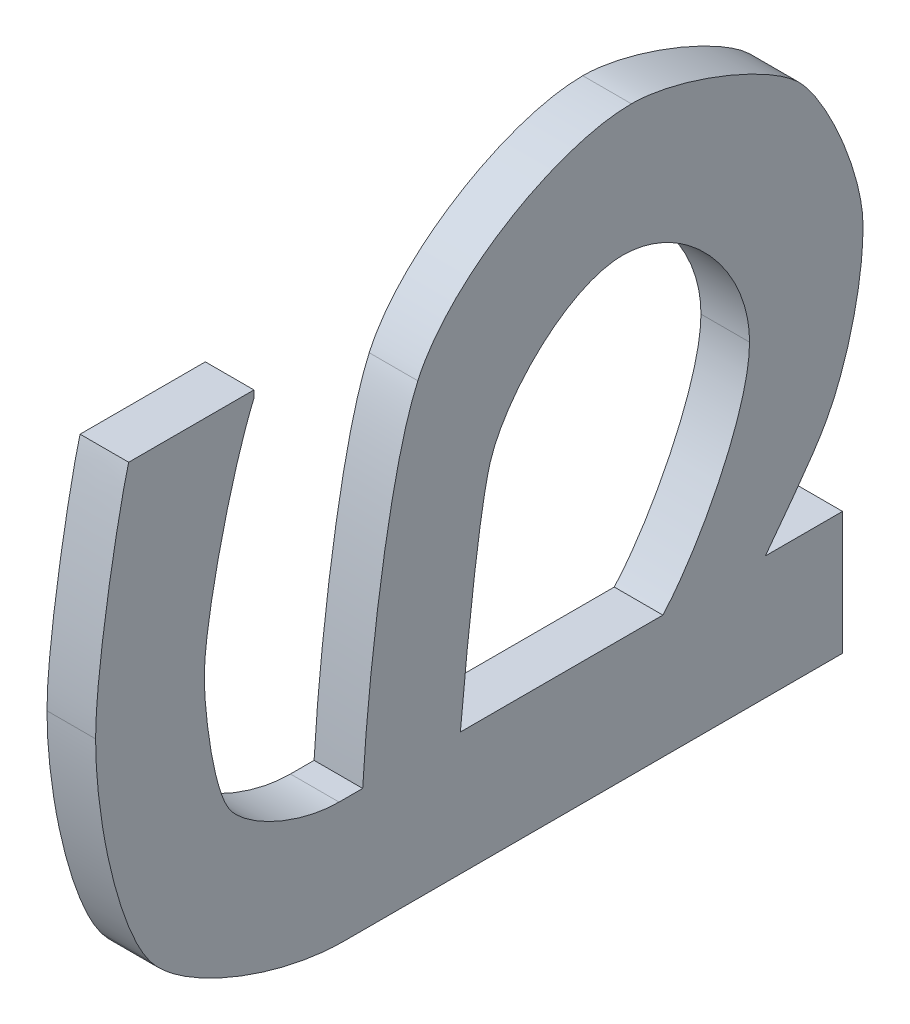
ISO-10303-21;
HEADER;
FILE_DESCRIPTION(('STEP AP214'),'2;1');
FILE_NAME('part.step','',(''),(''),'','','');
FILE_SCHEMA(('AUTOMOTIVE_DESIGN { 1 0 10303 214 1 1 1 1 }'));
ENDSEC;
DATA;
#1=APPLICATION_CONTEXT('core data for automotive mechanical design processes');
#2=APPLICATION_PROTOCOL_DEFINITION('international standard','automotive_design',2000,#1);
#3=PRODUCT_CONTEXT('',#1,'mechanical');
#4=PRODUCT('Part','Part','',(#3));
#5=PRODUCT_RELATED_PRODUCT_CATEGORY('part','',(#4));
#6=PRODUCT_DEFINITION_FORMATION('','',#4);
#7=PRODUCT_DEFINITION_CONTEXT('part definition',#1,'design');
#8=PRODUCT_DEFINITION('design','',#6,#7);
#9=PRODUCT_DEFINITION_SHAPE('','',#8);
#10=(LENGTH_UNIT() NAMED_UNIT(*) SI_UNIT(.MILLI.,.METRE.));
#11=(NAMED_UNIT(*) PLANE_ANGLE_UNIT() SI_UNIT($,.RADIAN.));
#12=(NAMED_UNIT(*) SI_UNIT($,.STERADIAN.) SOLID_ANGLE_UNIT());
#13=UNCERTAINTY_MEASURE_WITH_UNIT(LENGTH_MEASURE(1.E-05),#10,'distance_accuracy_value','');
#14=(GEOMETRIC_REPRESENTATION_CONTEXT(3) GLOBAL_UNCERTAINTY_ASSIGNED_CONTEXT((#13)) GLOBAL_UNIT_ASSIGNED_CONTEXT((#10,
#11,#12)) REPRESENTATION_CONTEXT('',''));
#15=CARTESIAN_POINT('',(0.,0.,0.));
#16=DIRECTION('',(0.,0.,1.));
#17=DIRECTION('',(1.,0.,0.));
#18=AXIS2_PLACEMENT_3D('',#15,#16,#17);
#19=CARTESIAN_POINT('',(-14.0348633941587,1.58473913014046,-0.050000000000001));
#20=DIRECTION('',(-1.,0.,0.));
#21=DIRECTION('',(0.,0.,1.));
#22=AXIS2_PLACEMENT_3D('',#19,#20,#21);
#23=PLANE('',#22);
#24=CARTESIAN_POINT('',(-14.0348633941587,3.46649328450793,-5.66883991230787));
#25=CARTESIAN_POINT('',(-14.0348633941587,3.47336080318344,-5.67095559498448));
#26=CARTESIAN_POINT('',(-14.0348633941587,3.4801071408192,-5.67342072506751));
#27=CARTESIAN_POINT('',(-14.0348633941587,3.49334960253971,-5.67891675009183));
#28=CARTESIAN_POINT('',(-14.0348633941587,3.49984624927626,-5.68194637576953));
#29=CARTESIAN_POINT('',(-14.0348633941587,3.51897594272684,-5.69169040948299));
#30=CARTESIAN_POINT('',(-14.0348633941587,3.53126891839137,-5.69906695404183));
#31=CARTESIAN_POINT('',(-14.0348633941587,3.56295005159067,-5.72047399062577));
#32=CARTESIAN_POINT('',(-14.0348633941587,3.58155997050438,-5.73564657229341));
#33=CARTESIAN_POINT('',(-14.0348633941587,3.61621059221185,-5.76882988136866));
#34=CARTESIAN_POINT('',(-14.0348633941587,3.63224124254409,-5.78685119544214));
#35=CARTESIAN_POINT('',(-14.0348633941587,3.65422035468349,-5.81689030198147));
#36=CARTESIAN_POINT('',(-14.0348633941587,3.66146082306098,-5.82796325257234));
#37=CARTESIAN_POINT('',(-14.0348633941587,3.67441983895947,-5.85087152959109));
#38=CARTESIAN_POINT('',(-14.0348633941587,3.68014984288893,-5.86270021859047));
#39=CARTESIAN_POINT('',(-14.0348633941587,3.68893015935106,-5.88540744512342));
#40=CARTESIAN_POINT('',(-14.0348633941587,3.69224748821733,-5.89617762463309));
#41=CARTESIAN_POINT('',(-14.0348633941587,3.69692116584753,-5.91829870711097));
#42=CARTESIAN_POINT('',(-14.0348633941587,3.69824561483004,-5.92965610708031));
#43=CARTESIAN_POINT('',(-14.0348633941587,3.69825990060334,-5.94112516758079));
#44=B_SPLINE_CURVE_WITH_KNOTS('',3,(#24,#25,#26,#27,#28,#29,#30,#31,#32,#33,#34,#35,#36,#37,#38,
#39,#40,#41,#42,#43),.UNSPECIFIED.,.F.,.F.,(4,2,2,2,2,2,2,2,2,4),(0.,0.0215293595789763,
0.043010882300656,0.0859105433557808,0.157615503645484,0.229593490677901,0.269201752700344,
0.308500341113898,0.342141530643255,0.376315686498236),.UNSPECIFIED.);
#45=CARTESIAN_POINT('',(-14.0348633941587,3.46649328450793,-5.66883991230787));
#46=VERTEX_POINT('',#45);
#47=CARTESIAN_POINT('',(-14.0348633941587,3.69825990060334,-5.94112516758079));
#48=VERTEX_POINT('',#47);
#49=EDGE_CURVE('E415',#46,#48,#44,.T.);
#50=ORIENTED_EDGE('',*,*,#49,.T.);
#51=CARTESIAN_POINT('',(-14.0348633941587,3.69825990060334,-5.94112516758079));
#52=CARTESIAN_POINT('',(-14.0348633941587,3.69826618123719,-5.95182238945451));
#53=CARTESIAN_POINT('',(-14.0348633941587,3.69726877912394,-5.96246305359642));
#54=CARTESIAN_POINT('',(-14.0348633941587,3.69355988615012,-5.9833537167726));
#55=CARTESIAN_POINT('',(-14.0348633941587,3.69086319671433,-5.99360628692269));
#56=CARTESIAN_POINT('',(-14.0348633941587,3.6783126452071,-6.03044147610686));
#57=CARTESIAN_POINT('',(-14.0348633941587,3.66404307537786,-6.05554834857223));
#58=CARTESIAN_POINT('',(-14.0348633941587,3.63553027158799,-6.09272678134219));
#59=CARTESIAN_POINT('',(-14.0348633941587,3.62302976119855,-6.10628332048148));
#60=CARTESIAN_POINT('',(-14.0348633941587,3.59600088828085,-6.13119944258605));
#61=CARTESIAN_POINT('',(-14.0348633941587,3.58147032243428,-6.14255660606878));
#62=CARTESIAN_POINT('',(-14.0348633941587,3.53503925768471,-6.17306243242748));
#63=CARTESIAN_POINT('',(-14.0348633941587,3.50038155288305,-6.18854090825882));
#64=CARTESIAN_POINT('',(-14.0348633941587,3.45584608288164,-6.1982256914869));
#65=CARTESIAN_POINT('',(-14.0348633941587,3.44735566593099,-6.19964151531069));
#66=CARTESIAN_POINT('',(-14.0348633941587,3.43025376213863,-6.20156219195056));
#67=CARTESIAN_POINT('',(-14.0348633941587,3.42164203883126,-6.20206490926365));
#68=CARTESIAN_POINT('',(-14.0348633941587,3.41300868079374,-6.20206520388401));
#69=B_SPLINE_CURVE_WITH_KNOTS('',3,(#51,#52,#53,#54,#55,#56,#57,#58,#59,#60,#61,#62,#63,#64,#65,
#66,#67,#68),.UNSPECIFIED.,.F.,.F.,(4,2,2,2,2,2,2,2,4),(0.,0.0319559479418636,0.06363732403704,
0.148496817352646,0.203622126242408,0.258807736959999,0.369563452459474,0.395350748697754,
0.42119827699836),.UNSPECIFIED.);
#70=CARTESIAN_POINT('',(-14.0348633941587,3.41300868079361,-6.20206520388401));
#71=VERTEX_POINT('',#70);
#72=EDGE_CURVE('E428',#48,#71,#69,.T.);
#73=ORIENTED_EDGE('',*,*,#72,.T.);
#74=CARTESIAN_POINT('',(-14.0348633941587,3.41300868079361,-6.20206520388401));
#75=CARTESIAN_POINT('',(-14.0348633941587,3.40334419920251,-6.20203261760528));
#76=CARTESIAN_POINT('',(-14.0348633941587,3.39371365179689,-6.20138882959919));
#77=CARTESIAN_POINT('',(-14.0348633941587,3.37458963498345,-6.1991663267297));
#78=CARTESIAN_POINT('',(-14.0348633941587,3.36509581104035,-6.19759079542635));
#79=CARTESIAN_POINT('',(-14.0348633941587,3.34630734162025,-6.19380011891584));
#80=CARTESIAN_POINT('',(-14.0348633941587,3.33701182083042,-6.19158904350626));
#81=CARTESIAN_POINT('',(-14.0348633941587,3.31854784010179,-6.18665765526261));
#82=CARTESIAN_POINT('',(-14.0348633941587,3.30937952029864,-6.18393682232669));
#83=CARTESIAN_POINT('',(-14.0348633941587,3.28087672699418,-6.17478416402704));
#84=CARTESIAN_POINT('',(-14.0348633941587,3.2617726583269,-6.16763572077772));
#85=CARTESIAN_POINT('',(-14.0348633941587,3.22404882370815,-6.15198803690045));
#86=CARTESIAN_POINT('',(-14.0348633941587,3.20543133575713,-6.14348343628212));
#87=CARTESIAN_POINT('',(-14.0348633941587,3.17175620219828,-6.12683015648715));
#88=CARTESIAN_POINT('',(-14.0348633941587,3.15661449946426,-6.1188509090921));
#89=CARTESIAN_POINT('',(-14.0348633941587,3.12676481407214,-6.10213067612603));
#90=CARTESIAN_POINT('',(-14.0348633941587,3.11205667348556,-6.09338997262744));
#91=CARTESIAN_POINT('',(-14.0348633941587,3.083297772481,-6.07516454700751));
#92=CARTESIAN_POINT('',(-14.0348633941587,3.06924208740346,-6.06568769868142));
#93=CARTESIAN_POINT('',(-14.0348633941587,3.04871621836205,-6.05068701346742));
#94=CARTESIAN_POINT('',(-14.0348633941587,3.04196307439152,-6.04555235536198));
#95=CARTESIAN_POINT('',(-14.0348633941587,3.0287228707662,-6.03494205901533));
#96=CARTESIAN_POINT('',(-14.0348633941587,3.02223602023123,-6.02946616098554));
#97=CARTESIAN_POINT('',(-14.0348633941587,3.01592601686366,-6.02378319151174));
#98=B_SPLINE_CURVE_WITH_KNOTS('',3,(#74,#75,#76,#77,#78,#79,#80,#81,#82,#83,#84,#85,#86,#87,#88,
#89,#90,#91,#92,#93,#94,#95,#96,#97),.UNSPECIFIED.,.F.,.F.,(4,2,2,2,2,2,2,2,2,2,2,4),(0.,
0.0289287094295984,0.0577591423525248,0.0864089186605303,0.11508808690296,0.176204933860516,
0.237569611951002,0.288894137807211,0.340199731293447,0.391016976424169,0.416458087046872,
0.441918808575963),.UNSPECIFIED.);
#99=CARTESIAN_POINT('',(-14.0348633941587,3.01592601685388,-6.02378319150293));
#100=VERTEX_POINT('',#99);
#101=EDGE_CURVE('E423',#71,#100,#98,.T.);
#102=ORIENTED_EDGE('',*,*,#101,.T.);
#103=DIRECTION('',(0.,0.,-1.));
#104=VECTOR('',#103,1.);
#105=CARTESIAN_POINT('',(-14.0348633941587,3.01592601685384,-6.02378319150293));
#106=LINE('',#105,#104);
#107=CARTESIAN_POINT('',(-14.0348633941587,3.01592601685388,-5.60725158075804));
#108=VERTEX_POINT('',#107);
#109=EDGE_CURVE('E243',#100,#108,#106,.F.);
#110=ORIENTED_EDGE('',*,*,#109,.T.);
#111=CARTESIAN_POINT('',(-14.0348633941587,3.01592601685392,-5.60725158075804));
#112=CARTESIAN_POINT('',(-14.0348633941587,3.03251920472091,-5.60874614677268));
#113=CARTESIAN_POINT('',(-14.0348633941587,3.0491061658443,-5.61030695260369));
#114=CARTESIAN_POINT('',(-14.0348633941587,3.08226903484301,-5.61354408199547));
#115=CARTESIAN_POINT('',(-14.0348633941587,3.09884494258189,-5.61522040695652));
#116=CARTESIAN_POINT('',(-14.0348633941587,3.14859164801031,-5.62040070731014));
#117=CARTESIAN_POINT('',(-14.0348633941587,3.1817473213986,-5.62405286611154));
#118=CARTESIAN_POINT('',(-14.0348633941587,3.23595622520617,-5.63045699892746));
#119=CARTESIAN_POINT('',(-14.0348633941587,3.25702782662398,-5.63305363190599));
#120=CARTESIAN_POINT('',(-14.0348633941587,3.29912413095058,-5.63853526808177));
#121=CARTESIAN_POINT('',(-14.0348633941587,3.32014885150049,-5.64142013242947));
#122=CARTESIAN_POINT('',(-14.0348633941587,3.35166548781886,-5.64610128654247));
#123=CARTESIAN_POINT('',(-14.0348633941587,3.36218312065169,-5.6477233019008));
#124=CARTESIAN_POINT('',(-14.0348633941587,3.38318929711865,-5.65113184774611));
#125=CARTESIAN_POINT('',(-14.0348633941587,3.393677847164,-5.65291833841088));
#126=CARTESIAN_POINT('',(-14.0348633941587,3.41462131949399,-5.65674107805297));
#127=CARTESIAN_POINT('',(-14.0348633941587,3.42507619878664,-5.65877756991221));
#128=CARTESIAN_POINT('',(-14.0348633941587,3.44069128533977,-5.66217078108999));
#129=CARTESIAN_POINT('',(-14.0348633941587,3.4458871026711,-5.66335878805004));
#130=CARTESIAN_POINT('',(-14.0348633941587,3.45623219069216,-5.66593123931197));
#131=CARTESIAN_POINT('',(-14.0348633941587,3.46138143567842,-5.66731578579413));
#132=CARTESIAN_POINT('',(-14.0348633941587,3.46649328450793,-5.66883991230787));
#133=B_SPLINE_CURVE_WITH_KNOTS('',3,(#111,#112,#113,#114,#115,#116,#117,#118,#119,#120,#121,
#122,#123,#124,#125,#126,#127,#128,#129,#130,#131,#132),.UNSPECIFIED.,.F.,.F.,(4,2,2,2,2,2,2,2,
2,2,4),(0.,0.0499805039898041,0.099961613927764,0.200026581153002,0.263718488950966,
0.327379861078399,0.359304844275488,0.39122211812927,0.423170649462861,0.439157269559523,
0.455152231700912),.UNSPECIFIED.);
#134=EDGE_CURVE('E433',#108,#46,#133,.T.);
#135=ORIENTED_EDGE('',*,*,#134,.T.);
#136=EDGE_LOOP('',(#50,#73,#102,#110,#135));
#137=FACE_BOUND('',#136,.T.);
#138=CARTESIAN_POINT('',(-14.0348633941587,3.01592601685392,-6.23448011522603));
#139=CARTESIAN_POINT('',(-14.0348633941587,3.0226058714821,-6.23945423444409));
#140=CARTESIAN_POINT('',(-14.0348633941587,3.02926116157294,-6.24446087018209));
#141=CARTESIAN_POINT('',(-14.0348633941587,3.04255873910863,-6.2544917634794));
#142=CARTESIAN_POINT('',(-14.0348633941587,3.04920102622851,-6.2595160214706));
#143=CARTESIAN_POINT('',(-14.0348633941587,3.06917862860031,-6.27455619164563));
#144=CARTESIAN_POINT('',(-14.0348633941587,3.08254825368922,-6.28452689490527));
#145=CARTESIAN_POINT('',(-14.0348633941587,3.10430629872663,-6.30045767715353));
#146=CARTESIAN_POINT('',(-14.0348633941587,3.1126409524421,-6.30649096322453));
#147=CARTESIAN_POINT('',(-14.0348633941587,3.12940271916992,-6.31841762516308));
#148=CARTESIAN_POINT('',(-14.0348633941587,3.13782977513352,-6.32431108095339));
#149=CARTESIAN_POINT('',(-14.0348633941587,3.15486072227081,-6.33590017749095));
#150=CARTESIAN_POINT('',(-14.0348633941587,3.16346509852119,-6.34159511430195));
#151=CARTESIAN_POINT('',(-14.0348633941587,3.17657970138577,-6.34982245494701));
#152=CARTESIAN_POINT('',(-14.0348633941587,3.18098842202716,-6.3525138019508));
#153=CARTESIAN_POINT('',(-14.0348633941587,3.18992684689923,-6.3576937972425));
#154=CARTESIAN_POINT('',(-14.0348633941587,3.19445663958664,-6.36018229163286));
#155=CARTESIAN_POINT('',(-14.0348633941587,3.19907026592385,-6.36251901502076));
#156=B_SPLINE_CURVE_WITH_KNOTS('',3,(#138,#139,#140,#141,#142,#143,#144,#145,#146,#147,#148,
#149,#150,#151,#152,#153,#154,#155),.UNSPECIFIED.,.F.,.F.,(4,2,2,2,2,2,2,2,4),(0.,
0.02498476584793,0.0499701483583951,0.100003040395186,0.13086961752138,0.161718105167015,
0.192666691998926,0.208158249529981,0.223661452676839),.UNSPECIFIED.);
#157=CARTESIAN_POINT('',(-14.0348633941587,3.01592601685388,-6.23448011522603));
#158=VERTEX_POINT('',#157);
#159=CARTESIAN_POINT('',(-14.0348633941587,3.19907026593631,-6.36251901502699));
#160=VERTEX_POINT('',#159);
#161=EDGE_CURVE('E486',#158,#160,#156,.T.);
#162=ORIENTED_EDGE('',*,*,#161,.T.);
#163=CARTESIAN_POINT('',(-14.0348633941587,3.19907026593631,-6.36251901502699));
#164=CARTESIAN_POINT('',(-14.0348633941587,3.20570198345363,-6.36606361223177));
#165=CARTESIAN_POINT('',(-14.0348633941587,3.21243857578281,-6.36940000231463));
#166=CARTESIAN_POINT('',(-14.0348633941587,3.22606709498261,-6.37572755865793));
#167=CARTESIAN_POINT('',(-14.0348633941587,3.23295891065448,-6.37871896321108));
#168=CARTESIAN_POINT('',(-14.0348633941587,3.25378778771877,-6.38728428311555));
#169=CARTESIAN_POINT('',(-14.0348633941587,3.26788988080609,-6.39245516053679));
#170=CARTESIAN_POINT('',(-14.0348633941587,3.29633231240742,-6.4019104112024));
#171=CARTESIAN_POINT('',(-14.0348633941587,3.31067171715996,-6.40619763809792));
#172=CARTESIAN_POINT('',(-14.0348633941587,3.33957458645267,-6.41396173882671));
#173=CARTESIAN_POINT('',(-14.0348633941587,3.35413816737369,-6.41743817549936));
#174=CARTESIAN_POINT('',(-14.0348633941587,3.39098659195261,-6.4251407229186));
#175=CARTESIAN_POINT('',(-14.0348633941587,3.41338853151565,-6.42883215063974));
#176=CARTESIAN_POINT('',(-14.0348633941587,3.44717448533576,-6.43269539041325));
#177=CARTESIAN_POINT('',(-14.0348633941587,3.45846550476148,-6.43370413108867));
#178=CARTESIAN_POINT('',(-14.0348633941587,3.48109205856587,-6.43508066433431));
#179=CARTESIAN_POINT('',(-14.0348633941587,3.49242761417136,-6.43544810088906));
#180=CARTESIAN_POINT('',(-14.0348633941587,3.50377043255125,-6.43545256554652));
#181=B_SPLINE_CURVE_WITH_KNOTS('',3,(#163,#164,#165,#166,#167,#168,#169,#170,#171,#172,#173,
#174,#175,#176,#177,#178,#179,#180),.UNSPECIFIED.,.F.,.F.,(4,2,2,2,2,2,2,2,4),(0.,
0.0225466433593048,0.0450776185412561,0.0901007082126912,0.134976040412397,0.179875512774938,
0.247878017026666,0.281870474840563,0.315881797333),.UNSPECIFIED.);
#182=CARTESIAN_POINT('',(-14.0348633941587,3.50377043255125,-6.43545256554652));
#183=VERTEX_POINT('',#182);
#184=EDGE_CURVE('E481',#160,#183,#181,.T.);
#185=ORIENTED_EDGE('',*,*,#184,.T.);
#186=CARTESIAN_POINT('',(-14.0348633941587,3.50377043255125,-6.43545256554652));
#187=CARTESIAN_POINT('',(-14.0348633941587,3.50863806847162,-6.43544686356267));
#188=CARTESIAN_POINT('',(-14.0348633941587,3.51350035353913,-6.43526000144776));
#189=CARTESIAN_POINT('',(-14.0348633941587,3.52319978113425,-6.43459336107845));
#190=CARTESIAN_POINT('',(-14.0348633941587,3.52803694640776,-6.43411392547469));
#191=CARTESIAN_POINT('',(-14.0348633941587,3.54247661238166,-6.43234347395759));
#192=CARTESIAN_POINT('',(-14.0348633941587,3.55203721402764,-6.43071942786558));
#193=CARTESIAN_POINT('',(-14.0348633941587,3.57102442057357,-6.42685450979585));
#194=CARTESIAN_POINT('',(-14.0348633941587,3.58045105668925,-6.42461378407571));
#195=CARTESIAN_POINT('',(-14.0348633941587,3.59918451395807,-6.41964827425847));
#196=CARTESIAN_POINT('',(-14.0348633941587,3.6084912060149,-6.41692300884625));
#197=CARTESIAN_POINT('',(-14.0348633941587,3.63628038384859,-6.40812806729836));
#198=CARTESIAN_POINT('',(-14.0348633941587,3.65457191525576,-6.4014526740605));
#199=CARTESIAN_POINT('',(-14.0348633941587,3.69060284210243,-6.38674296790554));
#200=CARTESIAN_POINT('',(-14.0348633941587,3.70834213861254,-6.37870841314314));
#201=CARTESIAN_POINT('',(-14.0348633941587,3.73475070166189,-6.36537741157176));
#202=CARTESIAN_POINT('',(-14.0348633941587,3.74369045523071,-6.36061532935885));
#203=CARTESIAN_POINT('',(-14.0348633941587,3.76130239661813,-6.35063752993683));
#204=CARTESIAN_POINT('',(-14.0348633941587,3.76997485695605,-6.34542229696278));
#205=CARTESIAN_POINT('',(-14.0348633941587,3.78696070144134,-6.33442901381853));
#206=CARTESIAN_POINT('',(-14.0348633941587,3.79527416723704,-6.32865109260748));
#207=CARTESIAN_POINT('',(-14.0348633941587,3.80731740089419,-6.3193965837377));
#208=CARTESIAN_POINT('',(-14.0348633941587,3.81126672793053,-6.31620814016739));
#209=CARTESIAN_POINT('',(-14.0348633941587,3.81895717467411,-6.30958044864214));
#210=CARTESIAN_POINT('',(-14.0348633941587,3.82269800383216,-6.30614086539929));
#211=CARTESIAN_POINT('',(-14.0348633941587,3.82629880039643,-6.30255142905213));
#212=B_SPLINE_CURVE_WITH_KNOTS('',3,(#186,#187,#188,#189,#190,#191,#192,#193,#194,#195,#196,
#197,#198,#199,#200,#201,#202,#203,#204,#205,#206,#207,#208,#209,#210,#211),.UNSPECIFIED.,.F.,
.F.,(4,2,2,2,2,2,2,2,2,2,2,2,4),(0.,0.0145919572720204,0.0291668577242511,0.0582272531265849,
0.0872807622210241,0.116363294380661,0.174712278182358,0.233071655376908,0.263447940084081,
0.29379215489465,0.324129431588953,0.339347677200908,0.354586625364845),.UNSPECIFIED.);
#213=CARTESIAN_POINT('',(-14.0348633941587,3.82629880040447,-6.30255142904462));
#214=VERTEX_POINT('',#213);
#215=EDGE_CURVE('E475',#183,#214,#212,.T.);
#216=ORIENTED_EDGE('',*,*,#215,.T.);
#217=CARTESIAN_POINT('',(-14.0348633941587,3.8262988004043,-6.30255142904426));
#218=CARTESIAN_POINT('',(-14.0348633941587,3.82939613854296,-6.29935843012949));
#219=CARTESIAN_POINT('',(-14.0348633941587,3.83235927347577,-6.29604382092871));
#220=CARTESIAN_POINT('',(-14.0348633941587,3.83806475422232,-6.28923648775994));
#221=CARTESIAN_POINT('',(-14.0348633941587,3.84080739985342,-6.28574401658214));
#222=CARTESIAN_POINT('',(-14.0348633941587,3.84877099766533,-6.27510605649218));
#223=CARTESIAN_POINT('',(-14.0348633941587,3.85374672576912,-6.26777885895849));
#224=CARTESIAN_POINT('',(-14.0348633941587,3.86322695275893,-6.25285364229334));
#225=CARTESIAN_POINT('',(-14.0348633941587,3.86773241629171,-6.24525622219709));
#226=CARTESIAN_POINT('',(-14.0348633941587,3.87638679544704,-6.22985172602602));
#227=CARTESIAN_POINT('',(-14.0348633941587,3.88053532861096,-6.22204443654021));
#228=CARTESIAN_POINT('',(-14.0348633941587,3.89325604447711,-6.19696300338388));
#229=CARTESIAN_POINT('',(-14.0348633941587,3.90126379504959,-6.17940206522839));
#230=CARTESIAN_POINT('',(-14.0348633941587,3.91608995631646,-6.14375907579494));
#231=CARTESIAN_POINT('',(-14.0348633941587,3.92290653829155,-6.12567627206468));
#232=CARTESIAN_POINT('',(-14.0348633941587,3.93313841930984,-6.09535999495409));
#233=CARTESIAN_POINT('',(-14.0348633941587,3.93691804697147,-6.08324940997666));
#234=CARTESIAN_POINT('',(-14.0348633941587,3.94382869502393,-6.05885601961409));
#235=CARTESIAN_POINT('',(-14.0348633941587,3.94696035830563,-6.04657339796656));
#236=CARTESIAN_POINT('',(-14.0348633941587,3.95239245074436,-6.02185071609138));
#237=CARTESIAN_POINT('',(-14.0348633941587,3.95469503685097,-6.00941115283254));
#238=CARTESIAN_POINT('',(-14.0348633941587,3.9572386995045,-5.99060388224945));
#239=CARTESIAN_POINT('',(-14.0348633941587,3.95793526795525,-5.98429987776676));
#240=CARTESIAN_POINT('',(-14.0348633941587,3.95891041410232,-5.97165161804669));
#241=CARTESIAN_POINT('',(-14.0348633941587,3.95918838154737,-5.96530731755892));
#242=CARTESIAN_POINT('',(-14.0348633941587,3.95919993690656,-5.95895336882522));
#243=B_SPLINE_CURVE_WITH_KNOTS('',3,(#217,#218,#219,#220,#221,#222,#223,#224,#225,#226,#227,
#228,#229,#230,#231,#232,#233,#234,#235,#236,#237,#238,#239,#240,#241,#242),.UNSPECIFIED.,.F.,
.F.,(4,2,2,2,2,2,2,2,2,2,2,2,4),(0.,0.0133326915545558,0.0266469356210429,0.0531902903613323,
0.0796780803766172,0.106193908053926,0.164037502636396,0.221969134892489,0.260014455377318,
0.298021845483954,0.335929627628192,0.354944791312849,0.373987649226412),.UNSPECIFIED.);
#244=CARTESIAN_POINT('',(-14.0348633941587,3.95919993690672,-5.95895336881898));
#245=VERTEX_POINT('',#244);
#246=EDGE_CURVE('E469',#214,#245,#243,.T.);
#247=ORIENTED_EDGE('',*,*,#246,.T.);
#248=CARTESIAN_POINT('',(-14.0348633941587,3.95919993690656,-5.9589533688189));
#249=CARTESIAN_POINT('',(-14.0348633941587,3.9591882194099,-5.94838013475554));
#250=CARTESIAN_POINT('',(-14.0348633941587,3.95859532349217,-5.93782846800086));
#251=CARTESIAN_POINT('',(-14.0348633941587,3.95643752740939,-5.91685036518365));
#252=CARTESIAN_POINT('',(-14.0348633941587,3.95487520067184,-5.90642367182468));
#253=CARTESIAN_POINT('',(-14.0348633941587,3.94903540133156,-5.8754902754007));
#254=CARTESIAN_POINT('',(-14.0348633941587,3.94360055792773,-5.85520636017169));
#255=CARTESIAN_POINT('',(-14.0348633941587,3.92615596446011,-5.80233852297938));
#256=CARTESIAN_POINT('',(-14.0348633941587,3.91217211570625,-5.77042063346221));
#257=CARTESIAN_POINT('',(-14.0348633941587,3.8793776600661,-5.70892205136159));
#258=CARTESIAN_POINT('',(-14.0348633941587,3.86053605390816,-5.6793580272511));
#259=CARTESIAN_POINT('',(-14.0348633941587,3.82538361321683,-5.63323666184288));
#260=CARTESIAN_POINT('',(-14.0348633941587,3.81038819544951,-5.6156731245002));
#261=CARTESIAN_POINT('',(-14.0348633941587,3.77826479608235,-5.58281560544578));
#262=CARTESIAN_POINT('',(-14.0348633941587,3.76115542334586,-5.56750409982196));
#263=CARTESIAN_POINT('',(-14.0348633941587,3.73386137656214,-5.54722778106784));
#264=CARTESIAN_POINT('',(-14.0348633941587,3.72463060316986,-5.54098645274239));
#265=CARTESIAN_POINT('',(-14.0348633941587,3.70547835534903,-5.5295141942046));
#266=CARTESIAN_POINT('',(-14.0348633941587,3.69555250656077,-5.52429062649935));
#267=CARTESIAN_POINT('',(-14.0348633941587,3.68529393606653,-5.5197313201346));
#268=B_SPLINE_CURVE_WITH_KNOTS('',3,(#248,#249,#250,#251,#252,#253,#254,#255,#256,#257,#258,
#259,#260,#261,#262,#263,#264,#265,#266,#267),.UNSPECIFIED.,.F.,.F.,(4,2,2,2,2,2,2,2,2,4),(0.,
0.0316726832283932,0.0632616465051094,0.126072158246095,0.230112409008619,0.334833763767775,
0.403972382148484,0.472540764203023,0.505910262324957,0.539512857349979),.UNSPECIFIED.);
#269=CARTESIAN_POINT('',(-14.0348633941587,3.68529393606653,-5.5197313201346));
#270=VERTEX_POINT('',#269);
#271=EDGE_CURVE('E463',#245,#270,#268,.T.);
#272=ORIENTED_EDGE('',*,*,#271,.T.);
#273=CARTESIAN_POINT('',(-14.0348633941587,3.68529393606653,-5.5197313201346));
#274=CARTESIAN_POINT('',(-14.0348633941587,3.67792467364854,-5.51635617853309));
#275=CARTESIAN_POINT('',(-14.0348633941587,3.67043903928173,-5.5132593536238));
#276=CARTESIAN_POINT('',(-14.0348633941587,3.65531480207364,-5.50748788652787));
#277=CARTESIAN_POINT('',(-14.0348633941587,3.64767637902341,-5.50481277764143));
#278=CARTESIAN_POINT('',(-14.0348633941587,3.63232584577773,-5.4997487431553));
#279=CARTESIAN_POINT('',(-14.0348633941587,3.62461392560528,-5.497359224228));
#280=CARTESIAN_POINT('',(-14.0348633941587,3.60912370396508,-5.4927968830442));
#281=CARTESIAN_POINT('',(-14.0348633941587,3.60134538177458,-5.49062413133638));
#282=CARTESIAN_POINT('',(-14.0348633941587,3.57799179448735,-5.48437328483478));
#283=CARTESIAN_POINT('',(-14.0348633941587,3.5623493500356,-5.48054731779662));
#284=CARTESIAN_POINT('',(-14.0348633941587,3.53095022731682,-5.47335903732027));
#285=CARTESIAN_POINT('',(-14.0348633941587,3.51519348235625,-5.46999702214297));
#286=CARTESIAN_POINT('',(-14.0348633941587,3.48379912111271,-5.46366675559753));
#287=CARTESIAN_POINT('',(-14.0348633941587,3.46816235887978,-5.46069424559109));
#288=CARTESIAN_POINT('',(-14.0348633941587,3.43684248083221,-5.45503039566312));
#289=CARTESIAN_POINT('',(-14.0348633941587,3.42115937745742,-5.45233898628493));
#290=CARTESIAN_POINT('',(-14.0348633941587,3.37400282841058,-5.44460875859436));
#291=CARTESIAN_POINT('',(-14.0348633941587,3.34247119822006,-5.43992349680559));
#292=CARTESIAN_POINT('',(-14.0348633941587,3.28636720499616,-5.43226850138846));
#293=CARTESIAN_POINT('',(-14.0348633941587,3.2618147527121,-5.42914939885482));
#294=CARTESIAN_POINT('',(-14.0348633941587,3.21266008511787,-5.42333788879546));
#295=CARTESIAN_POINT('',(-14.0348633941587,3.18805787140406,-5.42064546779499));
#296=CARTESIAN_POINT('',(-14.0348633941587,3.13889229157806,-5.41569664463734));
#297=CARTESIAN_POINT('',(-14.0348633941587,3.11432907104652,-5.41343881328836));
#298=CARTESIAN_POINT('',(-14.0348633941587,3.06515935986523,-5.40944412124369));
#299=CARTESIAN_POINT('',(-14.0348633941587,3.04055286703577,-5.40770728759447));
#300=CARTESIAN_POINT('',(-14.0348633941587,3.01592601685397,-5.40627913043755));
#301=B_SPLINE_CURVE_WITH_KNOTS('',3,(#273,#274,#275,#276,#277,#278,#279,#280,#281,#282,#283,
#284,#285,#286,#287,#288,#289,#290,#291,#292,#293,#294,#295,#296,#297,#298,#299,#300),
.UNSPECIFIED.,.F.,.F.,(4,2,2,2,2,2,2,2,2,2,2,2,2,4),(0.,0.0242962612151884,0.0485654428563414,
0.0727832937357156,0.0970090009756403,0.145307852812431,0.193637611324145,0.241384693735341,
0.28911995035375,0.384740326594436,0.458986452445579,0.533230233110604,0.607225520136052,
0.681224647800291),.UNSPECIFIED.);
#302=CARTESIAN_POINT('',(-14.0348633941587,3.0159260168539,-5.40627913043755));
#303=VERTEX_POINT('',#302);
#304=EDGE_CURVE('E457',#270,#303,#301,.T.);
#305=ORIENTED_EDGE('',*,*,#304,.T.);
#306=DIRECTION('',(0.,0.,-1.));
#307=VECTOR('',#306,1.);
#308=CARTESIAN_POINT('',(-14.0348633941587,3.01592601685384,-5.35765676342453));
#309=LINE('',#308,#307);
#310=CARTESIAN_POINT('',(-14.0348633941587,3.01592601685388,-5.35765676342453));
#311=VERTEX_POINT('',#310);
#312=EDGE_CURVE('E250',#303,#311,#309,.F.);
#313=ORIENTED_EDGE('',*,*,#312,.T.);
#314=CARTESIAN_POINT('',(-14.0348633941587,3.01592601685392,-5.35765676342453));
#315=CARTESIAN_POINT('',(-14.0348633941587,3.01593174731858,-5.35065094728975));
#316=CARTESIAN_POINT('',(-14.0348633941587,3.01626803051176,-5.34365435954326));
#317=CARTESIAN_POINT('',(-14.0348633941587,3.01750787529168,-5.32972226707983));
#318=CARTESIAN_POINT('',(-14.0348633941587,3.01841048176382,-5.32278667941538));
#319=CARTESIAN_POINT('',(-14.0348633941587,3.02187337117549,-5.30183403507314));
#320=CARTESIAN_POINT('',(-14.0348633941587,3.02518169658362,-5.28794310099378));
#321=CARTESIAN_POINT('',(-14.0348633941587,3.03517380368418,-5.25448986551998));
#322=CARTESIAN_POINT('',(-14.0348633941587,3.04270593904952,-5.23517712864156));
#323=CARTESIAN_POINT('',(-14.0348633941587,3.05621830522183,-5.20743740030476));
#324=CARTESIAN_POINT('',(-14.0348633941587,3.06106014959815,-5.19844006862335));
#325=CARTESIAN_POINT('',(-14.0348633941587,3.07158398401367,-5.18095027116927));
#326=CARTESIAN_POINT('',(-14.0348633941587,3.07726512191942,-5.17245730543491));
#327=CARTESIAN_POINT('',(-14.0348633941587,3.08837666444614,-5.15798327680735));
#328=CARTESIAN_POINT('',(-14.0348633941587,3.09360488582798,-5.15185140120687));
#329=CARTESIAN_POINT('',(-14.0348633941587,3.10213640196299,-5.14329402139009));
#330=CARTESIAN_POINT('',(-14.0348633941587,3.10510490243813,-5.14054112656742));
#331=CARTESIAN_POINT('',(-14.0348633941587,3.11133626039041,-5.13536445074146));
#332=CARTESIAN_POINT('',(-14.0348633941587,3.11460039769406,-5.13294222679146));
#333=CARTESIAN_POINT('',(-14.0348633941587,3.11803298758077,-5.13075238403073));
#334=B_SPLINE_CURVE_WITH_KNOTS('',3,(#314,#315,#316,#317,#318,#319,#320,#321,#322,#323,#324,
#325,#326,#327,#328,#329,#330,#331,#332,#333),.UNSPECIFIED.,.F.,.F.,(4,2,2,2,2,2,2,2,2,4),(0.,
0.0209963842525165,0.0419574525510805,0.0846875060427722,0.146575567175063,0.177197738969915,
0.207789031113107,0.231894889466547,0.244019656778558,0.256199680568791),.UNSPECIFIED.);
#335=CARTESIAN_POINT('',(-14.0348633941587,3.11803298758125,-5.13075238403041));
#336=VERTEX_POINT('',#335);
#337=EDGE_CURVE('E451',#311,#336,#334,.T.);
#338=ORIENTED_EDGE('',*,*,#337,.T.);
#339=CARTESIAN_POINT('',(-14.0348633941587,3.11803298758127,-5.13075238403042));
#340=CARTESIAN_POINT('',(-14.0348633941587,3.12221058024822,-5.1281536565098));
#341=CARTESIAN_POINT('',(-14.0348633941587,3.12654579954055,-5.12585107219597));
#342=CARTESIAN_POINT('',(-14.0348633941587,3.13540537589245,-5.12168056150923));
#343=CARTESIAN_POINT('',(-14.0348633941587,3.13992901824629,-5.11981114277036));
#344=CARTESIAN_POINT('',(-14.0348633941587,3.14904745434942,-5.1163420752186));
#345=CARTESIAN_POINT('',(-14.0348633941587,3.15364178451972,-5.11474113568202));
#346=CARTESIAN_POINT('',(-14.0348633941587,3.16290000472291,-5.11173581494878));
#347=CARTESIAN_POINT('',(-14.0348633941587,3.16756396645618,-5.11033165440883));
#348=CARTESIAN_POINT('',(-14.0348633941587,3.18896108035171,-5.10425006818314));
#349=CARTESIAN_POINT('',(-14.0348633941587,3.20593364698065,-5.10042587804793));
#350=CARTESIAN_POINT('',(-14.0348633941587,3.24014805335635,-5.09380970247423));
#351=CARTESIAN_POINT('',(-14.0348633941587,3.2573908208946,-5.09102303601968));
#352=CARTESIAN_POINT('',(-14.0348633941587,3.29232736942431,-5.08627937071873));
#353=CARTESIAN_POINT('',(-14.0348633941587,3.31002349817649,-5.08433912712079));
#354=CARTESIAN_POINT('',(-14.0348633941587,3.33654714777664,-5.08219238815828));
#355=CARTESIAN_POINT('',(-14.0348633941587,3.3453440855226,-5.08160506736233));
#356=CARTESIAN_POINT('',(-14.0348633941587,3.3629567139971,-5.08077462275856));
#357=CARTESIAN_POINT('',(-14.0348633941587,3.37177241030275,-5.08053162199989));
#358=CARTESIAN_POINT('',(-14.0348633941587,3.38059376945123,-5.0805092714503));
#359=B_SPLINE_CURVE_WITH_KNOTS('',3,(#339,#340,#341,#342,#343,#344,#345,#346,#347,#348,#349,
#350,#351,#352,#353,#354,#355,#356,#357,#358),.UNSPECIFIED.,.F.,.F.,(4,2,2,2,2,2,2,2,2,4),(0.,
0.0147164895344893,0.0293814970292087,0.0439738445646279,0.0585824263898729,0.110702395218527,
0.163085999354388,0.216464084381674,0.242908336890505,0.269362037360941),.UNSPECIFIED.);
#360=CARTESIAN_POINT('',(-14.0348633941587,3.38059376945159,-5.0805092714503));
#361=VERTEX_POINT('',#360);
#362=EDGE_CURVE('E445',#336,#361,#359,.T.);
#363=ORIENTED_EDGE('',*,*,#362,.T.);
#364=CARTESIAN_POINT('',(-14.0348633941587,3.3805937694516,-5.0805092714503));
#365=CARTESIAN_POINT('',(-14.0348633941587,3.38482389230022,-5.0805168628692));
#366=CARTESIAN_POINT('',(-14.0348633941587,3.38905146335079,-5.08062874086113));
#367=CARTESIAN_POINT('',(-14.0348633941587,3.39749784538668,-5.08100876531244));
#368=CARTESIAN_POINT('',(-14.0348633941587,3.40171665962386,-5.08127683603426));
#369=CARTESIAN_POINT('',(-14.0348633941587,3.41435272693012,-5.08223655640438));
#370=CARTESIAN_POINT('',(-14.0348633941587,3.42275753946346,-5.08308392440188));
#371=CARTESIAN_POINT('',(-14.0348633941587,3.43952405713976,-5.08503546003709));
#372=CARTESIAN_POINT('',(-14.0348633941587,3.44788580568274,-5.08613927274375));
#373=CARTESIAN_POINT('',(-14.0348633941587,3.46458450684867,-5.0885353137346));
#374=CARTESIAN_POINT('',(-14.0348633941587,3.4729214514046,-5.08982759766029));
#375=CARTESIAN_POINT('',(-14.0348633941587,3.49789179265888,-5.09392383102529));
#376=CARTESIAN_POINT('',(-14.0348633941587,3.51448906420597,-5.09694772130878));
#377=CARTESIAN_POINT('',(-14.0348633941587,3.54760304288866,-5.10343309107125));
#378=CARTESIAN_POINT('',(-14.0348633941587,3.56411971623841,-5.10689474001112));
#379=CARTESIAN_POINT('',(-14.0348633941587,3.60113500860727,-5.11510643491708));
#380=CARTESIAN_POINT('',(-14.0348633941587,3.62160998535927,-5.11996357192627));
#381=CARTESIAN_POINT('',(-14.0348633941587,3.6624038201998,-5.13028022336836));
#382=CARTESIAN_POINT('',(-14.0348633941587,3.68272270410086,-5.13573963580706));
#383=CARTESIAN_POINT('',(-14.0348633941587,3.72327990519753,-5.14740901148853));
#384=CARTESIAN_POINT('',(-14.0348633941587,3.7435170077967,-5.1536232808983));
#385=CARTESIAN_POINT('',(-14.0348633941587,3.77361292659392,-5.16373248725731));
#386=CARTESIAN_POINT('',(-14.0348633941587,3.78360254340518,-5.16723389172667));
#387=CARTESIAN_POINT('',(-14.0348633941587,3.80344624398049,-5.1746139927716));
#388=CARTESIAN_POINT('',(-14.0348633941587,3.8133002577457,-5.1784928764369));
#389=CARTESIAN_POINT('',(-14.0348633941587,3.82305730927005,-5.18261624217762));
#390=B_SPLINE_CURVE_WITH_KNOTS('',3,(#364,#365,#366,#367,#368,#369,#370,#371,#372,#373,#374,
#375,#376,#377,#378,#379,#380,#381,#382,#383,#384,#385,#386,#387,#388,#389),.UNSPECIFIED.,.F.,
.F.,(4,2,2,2,2,2,2,2,2,2,2,2,4),(0.,0.0126856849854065,0.0253652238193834,0.0507005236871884,
0.0760009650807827,0.101308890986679,0.151911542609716,0.20253384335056,0.265653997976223,
0.328763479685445,0.392251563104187,0.424001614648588,0.455767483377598),.UNSPECIFIED.);
#391=CARTESIAN_POINT('',(-14.0348633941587,3.8230573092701,-5.18261624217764));
#392=VERTEX_POINT('',#391);
#393=EDGE_CURVE('E439',#361,#392,#390,.T.);
#394=ORIENTED_EDGE('',*,*,#393,.T.);
#395=DIRECTION('',(0.,1.,0.));
#396=VECTOR('',#395,1.);
#397=CARTESIAN_POINT('',(-14.0348633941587,3.83764401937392,-5.18261624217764));
#398=LINE('',#397,#396);
#399=CARTESIAN_POINT('',(-14.0348633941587,3.83764401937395,-5.18261624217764));
#400=VERTEX_POINT('',#399);
#401=EDGE_CURVE('E170',#392,#400,#398,.T.);
#402=ORIENTED_EDGE('',*,*,#401,.T.);
#403=DIRECTION('',(0.,0.,-1.));
#404=VECTOR('',#403,1.);
#405=CARTESIAN_POINT('',(-14.0348633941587,3.83764401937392,-4.92491769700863));
#406=LINE('',#405,#404);
#407=CARTESIAN_POINT('',(-14.0348633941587,3.83764401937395,-4.92491769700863));
#408=VERTEX_POINT('',#407);
#409=EDGE_CURVE('E167',#400,#408,#406,.F.);
#410=ORIENTED_EDGE('',*,*,#409,.T.);
#411=CARTESIAN_POINT('',(-14.0348633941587,3.83764401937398,-4.92491769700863));
#412=CARTESIAN_POINT('',(-14.0348633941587,3.82957781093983,-4.92272243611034));
#413=CARTESIAN_POINT('',(-14.0348633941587,3.82147163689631,-4.92068821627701));
#414=CARTESIAN_POINT('',(-14.0348633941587,3.80521033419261,-4.91683157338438));
#415=CARTESIAN_POINT('',(-14.0348633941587,3.79705521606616,-4.91500910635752));
#416=CARTESIAN_POINT('',(-14.0348633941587,3.77256149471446,-4.90969353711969));
#417=CARTESIAN_POINT('',(-14.0348633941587,3.75619087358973,-4.90635137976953));
#418=CARTESIAN_POINT('',(-14.0348633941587,3.72338138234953,-4.89993388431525));
#419=CARTESIAN_POINT('',(-14.0348633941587,3.70694246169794,-4.89685880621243));
#420=CARTESIAN_POINT('',(-14.0348633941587,3.67402201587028,-4.89093921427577));
#421=CARTESIAN_POINT('',(-14.0348633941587,3.65754048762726,-4.88809471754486));
#422=CARTESIAN_POINT('',(-14.0348633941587,3.61938884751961,-4.88178509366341));
#423=CARTESIAN_POINT('',(-14.0348633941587,3.59770488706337,-4.87840336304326));
#424=CARTESIAN_POINT('',(-14.0348633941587,3.55427804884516,-4.87210319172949));
#425=CARTESIAN_POINT('',(-14.0348633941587,3.53253520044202,-4.86918455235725));
#426=CARTESIAN_POINT('',(-14.0348633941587,3.49981873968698,-4.86527961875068));
#427=CARTESIAN_POINT('',(-14.0348633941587,3.48887375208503,-4.86405479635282));
#428=CARTESIAN_POINT('',(-14.0348633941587,3.46696433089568,-4.86181225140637));
#429=CARTESIAN_POINT('',(-14.0348633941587,3.45599990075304,-4.86079449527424));
#430=CARTESIAN_POINT('',(-14.0348633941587,3.4340393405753,-4.85902567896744));
#431=CARTESIAN_POINT('',(-14.0348633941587,3.42304319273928,-4.85827482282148));
#432=CARTESIAN_POINT('',(-14.0348633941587,3.40102509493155,-4.85720004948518));
#433=CARTESIAN_POINT('',(-14.0348633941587,3.39000313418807,-4.85687636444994));
#434=CARTESIAN_POINT('',(-14.0348633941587,3.37897302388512,-4.85684638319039));
#435=B_SPLINE_CURVE_WITH_KNOTS('',3,(#411,#412,#413,#414,#415,#416,#417,#418,#419,#420,#421,
#422,#423,#424,#425,#426,#427,#428,#429,#430,#431,#432,#433,#434),.UNSPECIFIED.,.F.,.F.,(4,2,2,
2,2,2,2,2,2,2,2,4),(0.,0.0250718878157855,0.0501385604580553,0.100260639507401,
0.150430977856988,0.200605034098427,0.266439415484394,0.332245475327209,0.36528379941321,
0.398316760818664,0.431374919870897,0.464451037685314),.UNSPECIFIED.);
#436=CARTESIAN_POINT('',(-14.0348633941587,3.37897302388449,-4.85684638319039));
#437=VERTEX_POINT('',#436);
#438=EDGE_CURVE('E24',#408,#437,#435,.T.);
#439=ORIENTED_EDGE('',*,*,#438,.T.);
#440=CARTESIAN_POINT('',(-14.0348633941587,3.37897302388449,-4.85684638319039));
#441=CARTESIAN_POINT('',(-14.0348633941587,3.36224230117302,-4.85686840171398));
#442=CARTESIAN_POINT('',(-14.0348633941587,3.3455214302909,-4.85740599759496));
#443=CARTESIAN_POINT('',(-14.0348633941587,3.31213740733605,-4.85936161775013));
#444=CARTESIAN_POINT('',(-14.0348633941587,3.29547423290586,-4.86077925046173));
#445=CARTESIAN_POINT('',(-14.0348633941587,3.26210908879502,-4.8643573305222));
#446=CARTESIAN_POINT('',(-14.0348633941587,3.24540770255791,-4.86652304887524));
#447=CARTESIAN_POINT('',(-14.0348633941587,3.21210677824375,-4.87154441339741));
#448=CARTESIAN_POINT('',(-14.0348633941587,3.19550725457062,-4.87440015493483));
#449=CARTESIAN_POINT('',(-14.0348633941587,3.15721478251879,-4.88180231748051));
#450=CARTESIAN_POINT('',(-14.0348633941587,3.13556961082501,-4.88659783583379));
#451=CARTESIAN_POINT('',(-14.0348633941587,3.09266744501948,-4.89746562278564));
#452=CARTESIAN_POINT('',(-14.0348633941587,3.07140942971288,-4.90353375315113));
#453=CARTESIAN_POINT('',(-14.0348633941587,3.03959400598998,-4.91398268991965));
#454=CARTESIAN_POINT('',(-14.0348633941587,3.02883817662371,-4.91775830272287));
#455=CARTESIAN_POINT('',(-14.0348633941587,3.00754301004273,-4.92584713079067));
#456=CARTESIAN_POINT('',(-14.0348633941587,2.99700343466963,-4.93015971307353));
#457=CARTESIAN_POINT('',(-14.0348633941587,2.97616704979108,-4.93951492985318));
#458=CARTESIAN_POINT('',(-14.0348633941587,2.96587209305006,-4.94456182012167));
#459=CARTESIAN_POINT('',(-14.0348633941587,2.95082684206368,-4.95290195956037));
#460=CARTESIAN_POINT('',(-14.0348633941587,2.94586894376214,-4.95581656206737));
#461=CARTESIAN_POINT('',(-14.0348633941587,2.9361553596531,-4.96197912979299));
#462=CARTESIAN_POINT('',(-14.0348633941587,2.93140000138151,-4.96522760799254));
#463=CARTESIAN_POINT('',(-14.0348633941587,2.92678501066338,-4.96867782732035));
#464=B_SPLINE_CURVE_WITH_KNOTS('',3,(#440,#441,#442,#443,#444,#445,#446,#447,#448,#449,#450,
#451,#452,#453,#454,#455,#456,#457,#458,#459,#460,#461,#462,#463),.UNSPECIFIED.,.F.,.F.,(4,2,2,
2,2,2,2,2,2,2,2,4),(0.,0.0501708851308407,0.100319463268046,0.15082884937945,0.201345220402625,
0.267822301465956,0.334086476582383,0.368273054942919,0.402419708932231,0.436772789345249,
0.454014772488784,0.471283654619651),.UNSPECIFIED.);
#465=CARTESIAN_POINT('',(-14.0348633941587,2.92678501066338,-4.96867782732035));
#466=VERTEX_POINT('',#465);
#467=EDGE_CURVE('E231',#437,#466,#464,.T.);
#468=ORIENTED_EDGE('',*,*,#467,.T.);
#469=CARTESIAN_POINT('',(-14.0348633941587,2.92678501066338,-4.96867782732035));
#470=CARTESIAN_POINT('',(-14.0348633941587,2.92198044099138,-4.97227184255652));
#471=CARTESIAN_POINT('',(-14.0348633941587,2.91739443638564,-4.97613223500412));
#472=CARTESIAN_POINT('',(-14.0348633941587,2.90860797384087,-4.98424567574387));
#473=CARTESIAN_POINT('',(-14.0348633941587,2.90440634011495,-4.98849744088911));
#474=CARTESIAN_POINT('',(-14.0348633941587,2.89230888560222,-5.00161294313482));
#475=CARTESIAN_POINT('',(-14.0348633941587,2.88486194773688,-5.01088516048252));
#476=CARTESIAN_POINT('',(-14.0348633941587,2.8682935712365,-5.03357818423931));
#477=CARTESIAN_POINT('',(-14.0348633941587,2.85955878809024,-5.04727393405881));
#478=CARTESIAN_POINT('',(-14.0348633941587,2.84333035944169,-5.07538628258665));
#479=CARTESIAN_POINT('',(-14.0348633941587,2.83583808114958,-5.08980365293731));
#480=CARTESIAN_POINT('',(-14.0348633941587,2.82183118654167,-5.11931686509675));
#481=CARTESIAN_POINT('',(-14.0348633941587,2.81532953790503,-5.13441881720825));
#482=CARTESIAN_POINT('',(-14.0348633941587,2.80333830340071,-5.16501948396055));
#483=CARTESIAN_POINT('',(-14.0348633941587,2.79784880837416,-5.18051823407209));
#484=CARTESIAN_POINT('',(-14.0348633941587,2.78842178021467,-5.21019625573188));
#485=CARTESIAN_POINT('',(-14.0348633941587,2.78438176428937,-5.22434296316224));
#486=CARTESIAN_POINT('',(-14.0348633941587,2.77720274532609,-5.25285525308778));
#487=CARTESIAN_POINT('',(-14.0348633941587,2.7740632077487,-5.26722070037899));
#488=CARTESIAN_POINT('',(-14.0348633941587,2.76887825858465,-5.2958088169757));
#489=CARTESIAN_POINT('',(-14.0348633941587,2.7668089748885,-5.31002696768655));
#490=CARTESIAN_POINT('',(-14.0348633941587,2.76393030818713,-5.3386136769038));
#491=CARTESIAN_POINT('',(-14.0348633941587,2.76312333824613,-5.35298247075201));
#492=CARTESIAN_POINT('',(-14.0348633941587,2.76308970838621,-5.36738123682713));
#493=B_SPLINE_CURVE_WITH_KNOTS('',3,(#469,#470,#471,#472,#473,#474,#475,#476,#477,#478,#479,
#480,#481,#482,#483,#484,#485,#486,#487,#488,#489,#490,#491,#492),.UNSPECIFIED.,.F.,.F.,(4,2,2,
2,2,2,2,2,2,2,2,4),(0.,0.0179677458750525,0.0358785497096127,0.0714748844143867,
0.120117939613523,0.168814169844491,0.218101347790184,0.267392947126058,0.311502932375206,
0.355586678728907,0.398639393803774,0.44177430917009),.UNSPECIFIED.);
#494=CARTESIAN_POINT('',(-14.0348633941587,2.76308970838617,-5.36738123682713));
#495=VERTEX_POINT('',#494);
#496=EDGE_CURVE('E227',#466,#495,#493,.T.);
#497=ORIENTED_EDGE('',*,*,#496,.T.);
#498=DIRECTION('',(0.,0.,1.));
#499=VECTOR('',#498,1.);
#500=CARTESIAN_POINT('',(-14.0348633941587,2.76308970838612,-6.3933131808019));
#501=LINE('',#500,#499);
#502=CARTESIAN_POINT('',(-14.0348633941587,2.76308970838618,-6.3933131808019));
#503=VERTEX_POINT('',#502);
#504=EDGE_CURVE('E221',#495,#503,#501,.F.);
#505=ORIENTED_EDGE('',*,*,#504,.T.);
#506=DIRECTION('',(0.,1.,0.));
#507=VECTOR('',#506,1.);
#508=CARTESIAN_POINT('',(-14.0348633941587,3.01592601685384,-6.3933131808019));
#509=LINE('',#508,#507);
#510=CARTESIAN_POINT('',(-14.0348633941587,3.01592601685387,-6.3933131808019));
#511=VERTEX_POINT('',#510);
#512=EDGE_CURVE('E194',#503,#511,#509,.T.);
#513=ORIENTED_EDGE('',*,*,#512,.T.);
#514=DIRECTION('',(0.,0.,-1.));
#515=VECTOR('',#514,1.);
#516=CARTESIAN_POINT('',(-14.0348633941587,3.01592601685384,-6.23448011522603));
#517=LINE('',#516,#515);
#518=EDGE_CURVE('E190',#511,#158,#517,.F.);
#519=ORIENTED_EDGE('',*,*,#518,.T.);
#520=EDGE_LOOP('',(#162,#185,#216,#247,#272,#305,#313,#338,#363,#394,#402,#410,#439,#468,#497,
#505,#513,#519));
#521=FACE_BOUND('',#520,.T.);
#522=ADVANCED_FACE('F17',(#137,#521),#23,.F.);
#523=CARTESIAN_POINT('',(-39.7858458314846,3.83764401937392,-5.18261624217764));
#524=DIRECTION('',(0.,0.,1.));
#525=DIRECTION('',(1.,0.,0.));
#526=AXIS2_PLACEMENT_3D('',#523,#524,#525);
#527=PLANE('',#526);
#528=DIRECTION('',(1.,0.,0.));
#529=VECTOR('',#528,1.);
#530=CARTESIAN_POINT('',(-39.7858458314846,3.83764401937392,-5.18261624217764));
#531=LINE('',#530,#529);
#532=CARTESIAN_POINT('',(-14.1348633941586,3.83764401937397,-5.18261624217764));
#533=VERTEX_POINT('',#532);
#534=EDGE_CURVE('E238',#533,#400,#531,.T.);
#535=ORIENTED_EDGE('',*,*,#534,.T.);
#536=ORIENTED_EDGE('',*,*,#401,.F.);
#537=DIRECTION('',(-1.,-1.12757025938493E-13,0.));
#538=VECTOR('',#537,1.);
#539=CARTESIAN_POINT('',(-14.0848633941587,3.8230573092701,-5.18261624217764));
#540=LINE('',#539,#538);
#541=CARTESIAN_POINT('',(-14.1348633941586,3.8230573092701,-5.18261624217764));
#542=VERTEX_POINT('',#541);
#543=EDGE_CURVE('E246',#392,#542,#540,.T.);
#544=ORIENTED_EDGE('',*,*,#543,.T.);
#545=DIRECTION('',(0.,1.,0.));
#546=VECTOR('',#545,1.);
#547=CARTESIAN_POINT('',(-14.1348633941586,1.58473913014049,-5.18261624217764));
#548=LINE('',#547,#546);
#549=EDGE_CURVE('E711',#542,#533,#548,.T.);
#550=ORIENTED_EDGE('',*,*,#549,.T.);
#551=EDGE_LOOP('',(#535,#536,#544,#550));
#552=FACE_BOUND('',#551,.T.);
#553=ADVANCED_FACE('F409',(#552),#527,.F.);
#554=CARTESIAN_POINT('',(-39.7858458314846,3.83764401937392,-4.92491769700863));
#555=DIRECTION('',(0.,-1.,0.));
#556=DIRECTION('',(0.,0.,-1.));
#557=AXIS2_PLACEMENT_3D('',#554,#555,#556);
#558=PLANE('',#557);
#559=DIRECTION('',(1.,0.,0.));
#560=VECTOR('',#559,1.);
#561=CARTESIAN_POINT('',(-14.0848633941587,3.837644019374,-4.92491769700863));
#562=LINE('',#561,#560);
#563=CARTESIAN_POINT('',(-14.1348633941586,3.837644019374,-4.92491769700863));
#564=VERTEX_POINT('',#563);
#565=EDGE_CURVE('E235',#564,#408,#562,.T.);
#566=ORIENTED_EDGE('',*,*,#565,.T.);
#567=ORIENTED_EDGE('',*,*,#409,.F.);
#568=ORIENTED_EDGE('',*,*,#534,.F.);
#569=DIRECTION('',(0.,0.,-1.));
#570=VECTOR('',#569,1.);
#571=CARTESIAN_POINT('',(-14.1348633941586,3.837644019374,0.));
#572=LINE('',#571,#570);
#573=EDGE_CURVE('E708',#533,#564,#572,.F.);
#574=ORIENTED_EDGE('',*,*,#573,.T.);
#575=EDGE_LOOP('',(#566,#567,#568,#574));
#576=FACE_BOUND('',#575,.T.);
#577=ADVANCED_FACE('F740',(#576),#558,.F.);
#578=CARTESIAN_POINT('',(-14.1348633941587,3.37897302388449,-4.85684638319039));
#579=CARTESIAN_POINT('',(-14.0348633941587,3.37897302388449,-4.85684638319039));
#580=CARTESIAN_POINT('',(-14.1348633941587,3.50701192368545,-4.85684638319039));
#581=CARTESIAN_POINT('',(-14.0348633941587,3.50701192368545,-4.85684638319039));
#582=CARTESIAN_POINT('',(-14.1348633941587,3.76795195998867,-4.90546875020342));
#583=CARTESIAN_POINT('',(-14.0348633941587,3.76795195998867,-4.90546875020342));
#584=CARTESIAN_POINT('',(-14.1348633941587,3.837644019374,-4.92491769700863));
#585=CARTESIAN_POINT('',(-14.0348633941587,3.837644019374,-4.92491769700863));
#586=B_SPLINE_SURFACE_WITH_KNOTS('',3,1,((#578,#579),(#580,#581),(#582,#583),(#584,#585)),
.UNSPECIFIED.,.F.,.F.,.F.,(4,4),(2,2),(0.,1.),(0.,0.01),.UNSPECIFIED.);
#587=DIRECTION('',(1.,0.,0.));
#588=VECTOR('',#587,1.);
#589=CARTESIAN_POINT('',(-14.0848633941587,3.37897302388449,-4.85684638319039));
#590=LINE('',#589,#588);
#591=CARTESIAN_POINT('',(-14.1348633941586,3.37897302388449,-4.85684638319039));
#592=VERTEX_POINT('',#591);
#593=EDGE_CURVE('E232',#592,#437,#590,.T.);
#594=CARTESIAN_POINT('',(-14.1348633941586,3.837644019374,-4.92491769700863));
#595=CARTESIAN_POINT('',(-14.1348633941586,3.82957781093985,-4.92272243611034));
#596=CARTESIAN_POINT('',(-14.1348633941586,3.82147163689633,-4.92068821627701));
#597=CARTESIAN_POINT('',(-14.1348633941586,3.80521033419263,-4.91683157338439));
#598=CARTESIAN_POINT('',(-14.1348633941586,3.79705521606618,-4.91500910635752));
#599=CARTESIAN_POINT('',(-14.1348633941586,3.77256149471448,-4.9096935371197));
#600=CARTESIAN_POINT('',(-14.1348633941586,3.75619087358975,-4.90635137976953));
#601=CARTESIAN_POINT('',(-14.1348633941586,3.72338138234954,-4.89993388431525));
#602=CARTESIAN_POINT('',(-14.1348633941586,3.70694246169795,-4.89685880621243));
#603=CARTESIAN_POINT('',(-14.1348633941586,3.6740220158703,-4.89093921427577));
#604=CARTESIAN_POINT('',(-14.1348633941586,3.65754048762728,-4.88809471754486));
#605=CARTESIAN_POINT('',(-14.1348633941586,3.61938884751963,-4.88178509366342));
#606=CARTESIAN_POINT('',(-14.1348633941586,3.59770488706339,-4.87840336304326));
#607=CARTESIAN_POINT('',(-14.1348633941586,3.55427804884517,-4.87210319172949));
#608=CARTESIAN_POINT('',(-14.1348633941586,3.53253520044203,-4.86918455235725));
#609=CARTESIAN_POINT('',(-14.1348633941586,3.49981873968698,-4.86527961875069));
#610=CARTESIAN_POINT('',(-14.1348633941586,3.48887375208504,-4.86405479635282));
#611=CARTESIAN_POINT('',(-14.1348633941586,3.46696433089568,-4.86181225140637));
#612=CARTESIAN_POINT('',(-14.1348633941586,3.45599990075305,-4.86079449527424));
#613=CARTESIAN_POINT('',(-14.1348633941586,3.43403934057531,-4.85902567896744));
#614=CARTESIAN_POINT('',(-14.1348633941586,3.42304319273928,-4.85827482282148));
#615=CARTESIAN_POINT('',(-14.1348633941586,3.40102509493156,-4.85720004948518));
#616=CARTESIAN_POINT('',(-14.1348633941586,3.39000313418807,-4.85687636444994));
#617=CARTESIAN_POINT('',(-14.1348633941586,3.37897302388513,-4.85684638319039));
#618=B_SPLINE_CURVE_WITH_KNOTS('',3,(#594,#595,#596,#597,#598,#599,#600,#601,#602,#603,#604,
#605,#606,#607,#608,#609,#610,#611,#612,#613,#614,#615,#616,#617),.UNSPECIFIED.,.F.,.F.,(4,2,2,
2,2,2,2,2,2,2,2,4),(0.,0.0250718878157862,0.050138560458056,0.100260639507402,0.150430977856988,
0.200605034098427,0.266439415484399,0.332245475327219,0.365283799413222,0.398316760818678,
0.431374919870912,0.464451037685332),.UNSPECIFIED.);
#619=EDGE_CURVE('E373',#564,#592,#618,.T.);
#620=ORIENTED_EDGE('',*,*,#593,.T.);
#621=ORIENTED_EDGE('',*,*,#438,.F.);
#622=ORIENTED_EDGE('',*,*,#565,.F.);
#623=ORIENTED_EDGE('',*,*,#619,.T.);
#624=EDGE_LOOP('',(#620,#621,#622,#623));
#625=FACE_BOUND('',#624,.T.);
#626=ADVANCED_FACE('F384',(#625),#586,.F.);
#627=CARTESIAN_POINT('',(-14.1348633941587,2.92678501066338,-4.96867782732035));
#628=CARTESIAN_POINT('',(-14.0348633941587,2.92678501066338,-4.96867782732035));
#629=CARTESIAN_POINT('',(-14.1348633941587,3.01106378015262,-4.90546875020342));
#630=CARTESIAN_POINT('',(-14.0348633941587,3.01106378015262,-4.90546875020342));
#631=CARTESIAN_POINT('',(-14.1348633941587,3.22338144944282,-4.85684638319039));
#632=CARTESIAN_POINT('',(-14.0348633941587,3.22338144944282,-4.85684638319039));
#633=CARTESIAN_POINT('',(-14.1348633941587,3.37897302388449,-4.85684638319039));
#634=CARTESIAN_POINT('',(-14.0348633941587,3.37897302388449,-4.85684638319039));
#635=B_SPLINE_SURFACE_WITH_KNOTS('',3,1,((#627,#628),(#629,#630),(#631,#632),(#633,#634)),
.UNSPECIFIED.,.F.,.F.,.F.,(4,4),(2,2),(0.,1.),(0.,0.01),.UNSPECIFIED.);
#636=DIRECTION('',(1.,0.,0.));
#637=VECTOR('',#636,1.);
#638=CARTESIAN_POINT('',(-14.0848633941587,2.92678501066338,-4.96867782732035));
#639=LINE('',#638,#637);
#640=CARTESIAN_POINT('',(-14.1348633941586,2.92678501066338,-4.96867782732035));
#641=VERTEX_POINT('',#640);
#642=EDGE_CURVE('E228',#641,#466,#639,.T.);
#643=CARTESIAN_POINT('',(-14.1348633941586,3.37897302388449,-4.85684638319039));
#644=CARTESIAN_POINT('',(-14.1348633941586,3.36224230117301,-4.85686840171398));
#645=CARTESIAN_POINT('',(-14.1348633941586,3.3455214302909,-4.85740599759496));
#646=CARTESIAN_POINT('',(-14.1348633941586,3.31213740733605,-4.85936161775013));
#647=CARTESIAN_POINT('',(-14.1348633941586,3.29547423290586,-4.86077925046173));
#648=CARTESIAN_POINT('',(-14.1348633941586,3.26210908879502,-4.8643573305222));
#649=CARTESIAN_POINT('',(-14.1348633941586,3.24540770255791,-4.86652304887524));
#650=CARTESIAN_POINT('',(-14.1348633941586,3.21210677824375,-4.87154441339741));
#651=CARTESIAN_POINT('',(-14.1348633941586,3.19550725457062,-4.87440015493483));
#652=CARTESIAN_POINT('',(-14.1348633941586,3.15721478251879,-4.88180231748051));
#653=CARTESIAN_POINT('',(-14.1348633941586,3.13556961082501,-4.88659783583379));
#654=CARTESIAN_POINT('',(-14.1348633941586,3.09266744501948,-4.89746562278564));
#655=CARTESIAN_POINT('',(-14.1348633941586,3.07140942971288,-4.90353375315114));
#656=CARTESIAN_POINT('',(-14.1348633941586,3.03959400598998,-4.91398268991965));
#657=CARTESIAN_POINT('',(-14.1348633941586,3.02883817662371,-4.91775830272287));
#658=CARTESIAN_POINT('',(-14.1348633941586,3.00754301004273,-4.92584713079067));
#659=CARTESIAN_POINT('',(-14.1348633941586,2.99700343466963,-4.93015971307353));
#660=CARTESIAN_POINT('',(-14.1348633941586,2.97616704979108,-4.93951492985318));
#661=CARTESIAN_POINT('',(-14.1348633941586,2.96587209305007,-4.94456182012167));
#662=CARTESIAN_POINT('',(-14.1348633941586,2.95082684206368,-4.95290195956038));
#663=CARTESIAN_POINT('',(-14.1348633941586,2.94586894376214,-4.95581656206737));
#664=CARTESIAN_POINT('',(-14.1348633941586,2.9361553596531,-4.96197912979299));
#665=CARTESIAN_POINT('',(-14.1348633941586,2.93140000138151,-4.96522760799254));
#666=CARTESIAN_POINT('',(-14.1348633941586,2.92678501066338,-4.96867782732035));
#667=B_SPLINE_CURVE_WITH_KNOTS('',3,(#643,#644,#645,#646,#647,#648,#649,#650,#651,#652,#653,
#654,#655,#656,#657,#658,#659,#660,#661,#662,#663,#664,#665,#666),.UNSPECIFIED.,.F.,.F.,(4,2,2,
2,2,2,2,2,2,2,2,4),(0.,0.0501708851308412,0.100319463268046,0.15082884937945,0.201345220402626,
0.267822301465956,0.334086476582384,0.36827305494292,0.402419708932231,0.436772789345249,
0.454014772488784,0.471283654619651),.UNSPECIFIED.);
#668=EDGE_CURVE('E367',#592,#641,#667,.T.);
#669=ORIENTED_EDGE('',*,*,#642,.T.);
#670=ORIENTED_EDGE('',*,*,#467,.F.);
#671=ORIENTED_EDGE('',*,*,#593,.F.);
#672=ORIENTED_EDGE('',*,*,#668,.T.);
#673=EDGE_LOOP('',(#669,#670,#671,#672));
#674=FACE_BOUND('',#673,.T.);
#675=ADVANCED_FACE('F378',(#674),#635,.F.);
#676=CARTESIAN_POINT('',(-14.1348633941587,2.76308970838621,-5.36738123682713));
#677=CARTESIAN_POINT('',(-14.0348633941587,2.76308970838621,-5.36738123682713));
#678=CARTESIAN_POINT('',(-14.1348633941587,2.76308970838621,-5.22637637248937));
#679=CARTESIAN_POINT('',(-14.0348633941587,2.76308970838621,-5.22637637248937));
#680=CARTESIAN_POINT('',(-14.1348633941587,2.84412698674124,-5.03026615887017));
#681=CARTESIAN_POINT('',(-14.0348633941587,2.84412698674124,-5.03026615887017));
#682=CARTESIAN_POINT('',(-14.1348633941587,2.92678501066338,-4.96867782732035));
#683=CARTESIAN_POINT('',(-14.0348633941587,2.92678501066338,-4.96867782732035));
#684=B_SPLINE_SURFACE_WITH_KNOTS('',3,1,((#676,#677),(#678,#679),(#680,#681),(#682,#683)),
.UNSPECIFIED.,.F.,.F.,.F.,(4,4),(2,2),(0.,1.),(0.,0.01),.UNSPECIFIED.);
#685=DIRECTION('',(1.,0.,0.));
#686=VECTOR('',#685,1.);
#687=CARTESIAN_POINT('',(-39.7858458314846,2.76308970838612,-5.36738123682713));
#688=LINE('',#687,#686);
#689=CARTESIAN_POINT('',(-14.1348633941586,2.76308970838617,-5.36738123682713));
#690=VERTEX_POINT('',#689);
#691=EDGE_CURVE('E224',#690,#495,#688,.T.);
#692=CARTESIAN_POINT('',(-14.1348633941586,2.92678501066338,-4.96867782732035));
#693=CARTESIAN_POINT('',(-14.1348633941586,2.92198044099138,-4.97227184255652));
#694=CARTESIAN_POINT('',(-14.1348633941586,2.91739443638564,-4.97613223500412));
#695=CARTESIAN_POINT('',(-14.1348633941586,2.90860797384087,-4.98424567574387));
#696=CARTESIAN_POINT('',(-14.1348633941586,2.90440634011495,-4.98849744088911));
#697=CARTESIAN_POINT('',(-14.1348633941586,2.89230888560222,-5.00161294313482));
#698=CARTESIAN_POINT('',(-14.1348633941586,2.88486194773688,-5.01088516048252));
#699=CARTESIAN_POINT('',(-14.1348633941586,2.8682935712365,-5.03357818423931));
#700=CARTESIAN_POINT('',(-14.1348633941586,2.85955878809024,-5.04727393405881));
#701=CARTESIAN_POINT('',(-14.1348633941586,2.84333035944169,-5.07538628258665));
#702=CARTESIAN_POINT('',(-14.1348633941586,2.83583808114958,-5.08980365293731));
#703=CARTESIAN_POINT('',(-14.1348633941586,2.82183118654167,-5.11931686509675));
#704=CARTESIAN_POINT('',(-14.1348633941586,2.81532953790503,-5.13441881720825));
#705=CARTESIAN_POINT('',(-14.1348633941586,2.80333830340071,-5.16501948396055));
#706=CARTESIAN_POINT('',(-14.1348633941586,2.79784880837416,-5.18051823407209));
#707=CARTESIAN_POINT('',(-14.1348633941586,2.78842178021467,-5.21019625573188));
#708=CARTESIAN_POINT('',(-14.1348633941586,2.78438176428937,-5.22434296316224));
#709=CARTESIAN_POINT('',(-14.1348633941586,2.77720274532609,-5.25285525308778));
#710=CARTESIAN_POINT('',(-14.1348633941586,2.7740632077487,-5.26722070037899));
#711=CARTESIAN_POINT('',(-14.1348633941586,2.76887825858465,-5.2958088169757));
#712=CARTESIAN_POINT('',(-14.1348633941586,2.7668089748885,-5.31002696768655));
#713=CARTESIAN_POINT('',(-14.1348633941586,2.76393030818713,-5.3386136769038));
#714=CARTESIAN_POINT('',(-14.1348633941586,2.76312333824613,-5.35298247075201));
#715=CARTESIAN_POINT('',(-14.1348633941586,2.76308970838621,-5.36738123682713));
#716=B_SPLINE_CURVE_WITH_KNOTS('',3,(#692,#693,#694,#695,#696,#697,#698,#699,#700,#701,#702,
#703,#704,#705,#706,#707,#708,#709,#710,#711,#712,#713,#714,#715),.UNSPECIFIED.,.F.,.F.,(4,2,2,
2,2,2,2,2,2,2,2,4),(0.,0.0179677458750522,0.0358785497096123,0.0714748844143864,
0.120117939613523,0.168814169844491,0.218101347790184,0.267392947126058,0.311502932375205,
0.355586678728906,0.398639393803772,0.44177430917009),.UNSPECIFIED.);
#717=EDGE_CURVE('E213',#641,#690,#716,.T.);
#718=ORIENTED_EDGE('',*,*,#691,.T.);
#719=ORIENTED_EDGE('',*,*,#496,.F.);
#720=ORIENTED_EDGE('',*,*,#642,.F.);
#721=ORIENTED_EDGE('',*,*,#717,.T.);
#722=EDGE_LOOP('',(#718,#719,#720,#721));
#723=FACE_BOUND('',#722,.T.);
#724=ADVANCED_FACE('F383',(#723),#684,.F.);
#725=CARTESIAN_POINT('',(-39.7858458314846,2.76308970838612,-6.3933131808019));
#726=DIRECTION('',(0.,1.,0.));
#727=DIRECTION('',(0.,0.,1.));
#728=AXIS2_PLACEMENT_3D('',#725,#726,#727);
#729=PLANE('',#728);
#730=DIRECTION('',(1.,0.,0.));
#731=VECTOR('',#730,1.);
#732=CARTESIAN_POINT('',(-39.7858458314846,2.76308970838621,-6.3933131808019));
#733=LINE('',#732,#731);
#734=CARTESIAN_POINT('',(-14.1348633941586,2.76308970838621,-6.3933131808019));
#735=VERTEX_POINT('',#734);
#736=EDGE_CURVE('E210',#735,#503,#733,.T.);
#737=ORIENTED_EDGE('',*,*,#736,.T.);
#738=ORIENTED_EDGE('',*,*,#504,.F.);
#739=ORIENTED_EDGE('',*,*,#691,.F.);
#740=DIRECTION('',(0.,0.,-1.));
#741=VECTOR('',#740,1.);
#742=CARTESIAN_POINT('',(-14.1348633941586,2.76308970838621,0.));
#743=LINE('',#742,#741);
#744=EDGE_CURVE('E211',#690,#735,#743,.T.);
#745=ORIENTED_EDGE('',*,*,#744,.T.);
#746=EDGE_LOOP('',(#737,#738,#739,#745));
#747=FACE_BOUND('',#746,.T.);
#748=ADVANCED_FACE('F751',(#747),#729,.F.);
#749=CARTESIAN_POINT('',(-39.7858458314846,3.01592601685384,-6.3933131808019));
#750=DIRECTION('',(0.,0.,1.));
#751=DIRECTION('',(1.,0.,0.));
#752=AXIS2_PLACEMENT_3D('',#749,#750,#751);
#753=PLANE('',#752);
#754=DIRECTION('',(1.,0.,0.));
#755=VECTOR('',#754,1.);
#756=CARTESIAN_POINT('',(-39.7858458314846,3.01592601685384,-6.3933131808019));
#757=LINE('',#756,#755);
#758=CARTESIAN_POINT('',(-14.1348633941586,3.01592601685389,-6.3933131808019));
#759=VERTEX_POINT('',#758);
#760=EDGE_CURVE('E185',#759,#511,#757,.T.);
#761=ORIENTED_EDGE('',*,*,#760,.T.);
#762=ORIENTED_EDGE('',*,*,#512,.F.);
#763=ORIENTED_EDGE('',*,*,#736,.F.);
#764=DIRECTION('',(0.,1.,0.));
#765=VECTOR('',#764,1.);
#766=CARTESIAN_POINT('',(-14.1348633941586,1.58473913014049,-6.3933131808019));
#767=LINE('',#766,#765);
#768=EDGE_CURVE('E202',#735,#759,#767,.T.);
#769=ORIENTED_EDGE('',*,*,#768,.T.);
#770=EDGE_LOOP('',(#761,#762,#763,#769));
#771=FACE_BOUND('',#770,.T.);
#772=ADVANCED_FACE('F208',(#771),#753,.F.);
#773=CARTESIAN_POINT('',(-39.7858458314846,3.01592601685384,-6.23448011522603));
#774=DIRECTION('',(0.,-1.,0.));
#775=DIRECTION('',(0.,0.,-1.));
#776=AXIS2_PLACEMENT_3D('',#773,#774,#775);
#777=PLANE('',#776);
#778=DIRECTION('',(1.,0.,0.));
#779=VECTOR('',#778,1.);
#780=CARTESIAN_POINT('',(-14.0848633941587,3.01592601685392,-6.23448011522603));
#781=LINE('',#780,#779);
#782=CARTESIAN_POINT('',(-14.1348633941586,3.01592601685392,-6.23448011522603));
#783=VERTEX_POINT('',#782);
#784=EDGE_CURVE('E255',#783,#158,#781,.T.);
#785=ORIENTED_EDGE('',*,*,#784,.T.);
#786=ORIENTED_EDGE('',*,*,#518,.F.);
#787=ORIENTED_EDGE('',*,*,#760,.F.);
#788=DIRECTION('',(0.,0.,-1.));
#789=VECTOR('',#788,1.);
#790=CARTESIAN_POINT('',(-14.1348633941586,3.01592601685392,0.));
#791=LINE('',#790,#789);
#792=EDGE_CURVE('E189',#759,#783,#791,.F.);
#793=ORIENTED_EDGE('',*,*,#792,.T.);
#794=EDGE_LOOP('',(#785,#786,#787,#793));
#795=FACE_BOUND('',#794,.T.);
#796=ADVANCED_FACE('F188',(#795),#777,.F.);
#797=CARTESIAN_POINT('',(-14.1348633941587,3.19907026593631,-6.36251901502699));
#798=CARTESIAN_POINT('',(-14.0348633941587,3.19907026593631,-6.36251901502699));
#799=CARTESIAN_POINT('',(-14.1348633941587,3.15044789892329,-6.33820783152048));
#800=CARTESIAN_POINT('',(-14.0348633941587,3.15044789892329,-6.33820783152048));
#801=CARTESIAN_POINT('',(-14.1348633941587,3.04672018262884,-6.25717055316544));
#802=CARTESIAN_POINT('',(-14.0348633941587,3.04672018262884,-6.25717055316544));
#803=CARTESIAN_POINT('',(-14.1348633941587,3.01592601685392,-6.23448011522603));
#804=CARTESIAN_POINT('',(-14.0348633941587,3.01592601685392,-6.23448011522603));
#805=B_SPLINE_SURFACE_WITH_KNOTS('',3,1,((#797,#798),(#799,#800),(#801,#802),(#803,#804)),
.UNSPECIFIED.,.F.,.F.,.F.,(4,4),(2,2),(0.,1.),(0.,0.01),.UNSPECIFIED.);
#806=DIRECTION('',(1.,0.,0.));
#807=VECTOR('',#806,1.);
#808=CARTESIAN_POINT('',(-14.0848633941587,3.19907026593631,-6.36251901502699));
#809=LINE('',#808,#807);
#810=CARTESIAN_POINT('',(-14.1348633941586,3.19907026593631,-6.36251901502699));
#811=VERTEX_POINT('',#810);
#812=EDGE_CURVE('E490',#811,#160,#809,.T.);
#813=CARTESIAN_POINT('',(-14.1348633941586,3.01592601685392,-6.23448011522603));
#814=CARTESIAN_POINT('',(-14.1348633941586,3.0226058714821,-6.23945423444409));
#815=CARTESIAN_POINT('',(-14.1348633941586,3.02926116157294,-6.24446087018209));
#816=CARTESIAN_POINT('',(-14.1348633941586,3.04255873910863,-6.2544917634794));
#817=CARTESIAN_POINT('',(-14.1348633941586,3.04920102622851,-6.2595160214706));
#818=CARTESIAN_POINT('',(-14.1348633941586,3.06917862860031,-6.27455619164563));
#819=CARTESIAN_POINT('',(-14.1348633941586,3.08254825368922,-6.28452689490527));
#820=CARTESIAN_POINT('',(-14.1348633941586,3.10430629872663,-6.30045767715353));
#821=CARTESIAN_POINT('',(-14.1348633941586,3.1126409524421,-6.30649096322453));
#822=CARTESIAN_POINT('',(-14.1348633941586,3.12940271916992,-6.31841762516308));
#823=CARTESIAN_POINT('',(-14.1348633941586,3.13782977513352,-6.32431108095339));
#824=CARTESIAN_POINT('',(-14.1348633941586,3.15486072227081,-6.33590017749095));
#825=CARTESIAN_POINT('',(-14.1348633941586,3.16346509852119,-6.34159511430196));
#826=CARTESIAN_POINT('',(-14.1348633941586,3.17657970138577,-6.34982245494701));
#827=CARTESIAN_POINT('',(-14.1348633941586,3.18098842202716,-6.3525138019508));
#828=CARTESIAN_POINT('',(-14.1348633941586,3.18992684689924,-6.3576937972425));
#829=CARTESIAN_POINT('',(-14.1348633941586,3.19445663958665,-6.36018229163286));
#830=CARTESIAN_POINT('',(-14.1348633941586,3.19907026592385,-6.36251901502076));
#831=B_SPLINE_CURVE_WITH_KNOTS('',3,(#813,#814,#815,#816,#817,#818,#819,#820,#821,#822,#823,
#824,#825,#826,#827,#828,#829,#830),.UNSPECIFIED.,.F.,.F.,(4,2,2,2,2,2,2,2,4),(0.,
0.0249847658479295,0.0499701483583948,0.100003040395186,0.130869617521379,0.161718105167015,
0.192666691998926,0.208158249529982,0.223661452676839),.UNSPECIFIED.);
#832=EDGE_CURVE('E206',#783,#811,#831,.T.);
#833=ORIENTED_EDGE('',*,*,#812,.T.);
#834=ORIENTED_EDGE('',*,*,#161,.F.);
#835=ORIENTED_EDGE('',*,*,#784,.F.);
#836=ORIENTED_EDGE('',*,*,#832,.T.);
#837=EDGE_LOOP('',(#833,#834,#835,#836));
#838=FACE_BOUND('',#837,.T.);
#839=ADVANCED_FACE('F491',(#838),#805,.F.);
#840=CARTESIAN_POINT('',(-14.1348633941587,3.50377043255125,-6.43545256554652));
#841=CARTESIAN_POINT('',(-14.0348633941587,3.50377043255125,-6.43545256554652));
#842=CARTESIAN_POINT('',(-14.1348633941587,3.3903182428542,-6.43545256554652));
#843=CARTESIAN_POINT('',(-14.0348633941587,3.3903182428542,-6.43545256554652));
#844=CARTESIAN_POINT('',(-14.1348633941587,3.26552083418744,-6.39817541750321));
#845=CARTESIAN_POINT('',(-14.0348633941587,3.26552083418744,-6.39817541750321));
#846=CARTESIAN_POINT('',(-14.1348633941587,3.19907026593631,-6.36251901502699));
#847=CARTESIAN_POINT('',(-14.0348633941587,3.19907026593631,-6.36251901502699));
#848=B_SPLINE_SURFACE_WITH_KNOTS('',3,1,((#840,#841),(#842,#843),(#844,#845),(#846,#847)),
.UNSPECIFIED.,.F.,.F.,.F.,(4,4),(2,2),(0.,1.),(0.,0.01),.UNSPECIFIED.);
#849=DIRECTION('',(1.,0.,0.));
#850=VECTOR('',#849,1.);
#851=CARTESIAN_POINT('',(-14.0848633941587,3.50377043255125,-6.43545256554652));
#852=LINE('',#851,#850);
#853=CARTESIAN_POINT('',(-14.1348633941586,3.50377043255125,-6.43545256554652));
#854=VERTEX_POINT('',#853);
#855=EDGE_CURVE('E678',#854,#183,#852,.T.);
#856=CARTESIAN_POINT('',(-14.1348633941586,3.19907026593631,-6.36251901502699));
#857=CARTESIAN_POINT('',(-14.1348633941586,3.20570198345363,-6.36606361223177));
#858=CARTESIAN_POINT('',(-14.1348633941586,3.21243857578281,-6.36940000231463));
#859=CARTESIAN_POINT('',(-14.1348633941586,3.22606709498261,-6.37572755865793));
#860=CARTESIAN_POINT('',(-14.1348633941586,3.23295891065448,-6.37871896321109));
#861=CARTESIAN_POINT('',(-14.1348633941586,3.25378778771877,-6.38728428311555));
#862=CARTESIAN_POINT('',(-14.1348633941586,3.26788988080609,-6.39245516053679));
#863=CARTESIAN_POINT('',(-14.1348633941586,3.29633231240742,-6.4019104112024));
#864=CARTESIAN_POINT('',(-14.1348633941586,3.31067171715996,-6.40619763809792));
#865=CARTESIAN_POINT('',(-14.1348633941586,3.33957458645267,-6.41396173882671));
#866=CARTESIAN_POINT('',(-14.1348633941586,3.35413816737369,-6.41743817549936));
#867=CARTESIAN_POINT('',(-14.1348633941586,3.39098659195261,-6.4251407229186));
#868=CARTESIAN_POINT('',(-14.1348633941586,3.41338853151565,-6.42883215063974));
#869=CARTESIAN_POINT('',(-14.1348633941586,3.44717448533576,-6.43269539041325));
#870=CARTESIAN_POINT('',(-14.1348633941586,3.45846550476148,-6.43370413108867));
#871=CARTESIAN_POINT('',(-14.1348633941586,3.48109205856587,-6.43508066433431));
#872=CARTESIAN_POINT('',(-14.1348633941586,3.49242761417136,-6.43544810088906));
#873=CARTESIAN_POINT('',(-14.1348633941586,3.50377043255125,-6.43545256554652));
#874=B_SPLINE_CURVE_WITH_KNOTS('',3,(#856,#857,#858,#859,#860,#861,#862,#863,#864,#865,#866,
#867,#868,#869,#870,#871,#872,#873),.UNSPECIFIED.,.F.,.F.,(4,2,2,2,2,2,2,2,4),(0.,
0.0225466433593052,0.0450776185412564,0.0901007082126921,0.134976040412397,0.179875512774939,
0.247878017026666,0.281870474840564,0.315881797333),.UNSPECIFIED.);
#875=EDGE_CURVE('E350',#811,#854,#874,.T.);
#876=ORIENTED_EDGE('',*,*,#855,.T.);
#877=ORIENTED_EDGE('',*,*,#184,.F.);
#878=ORIENTED_EDGE('',*,*,#812,.F.);
#879=ORIENTED_EDGE('',*,*,#875,.T.);
#880=EDGE_LOOP('',(#876,#877,#878,#879));
#881=FACE_BOUND('',#880,.T.);
#882=ADVANCED_FACE('F496',(#881),#848,.F.);
#883=CARTESIAN_POINT('',(-14.1348633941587,3.8262988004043,-6.30255142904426));
#884=CARTESIAN_POINT('',(-14.0348633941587,3.8262988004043,-6.30255142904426));
#885=CARTESIAN_POINT('',(-14.1348633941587,3.76308972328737,-6.36576050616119));
#886=CARTESIAN_POINT('',(-14.0348633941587,3.76308972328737,-6.36576050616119));
#887=CARTESIAN_POINT('',(-14.1348633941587,3.59615292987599,-6.43545256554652));
#888=CARTESIAN_POINT('',(-14.0348633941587,3.59615292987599,-6.43545256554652));
#889=CARTESIAN_POINT('',(-14.1348633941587,3.50377043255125,-6.43545256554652));
#890=CARTESIAN_POINT('',(-14.0348633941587,3.50377043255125,-6.43545256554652));
#891=B_SPLINE_SURFACE_WITH_KNOTS('',3,1,((#883,#884),(#885,#886),(#887,#888),(#889,#890)),
.UNSPECIFIED.,.F.,.F.,.F.,(4,4),(2,2),(0.,1.),(0.,0.01),.UNSPECIFIED.);
#892=DIRECTION('',(1.,0.,0.));
#893=VECTOR('',#892,1.);
#894=CARTESIAN_POINT('',(-14.0848633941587,3.8262988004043,-6.30255142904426));
#895=LINE('',#894,#893);
#896=CARTESIAN_POINT('',(-14.1348633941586,3.8262988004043,-6.30255142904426));
#897=VERTEX_POINT('',#896);
#898=EDGE_CURVE('E675',#897,#214,#895,.T.);
#899=CARTESIAN_POINT('',(-14.1348633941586,3.50377043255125,-6.43545256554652));
#900=CARTESIAN_POINT('',(-14.1348633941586,3.50863806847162,-6.43544686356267));
#901=CARTESIAN_POINT('',(-14.1348633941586,3.51350035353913,-6.43526000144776));
#902=CARTESIAN_POINT('',(-14.1348633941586,3.52319978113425,-6.43459336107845));
#903=CARTESIAN_POINT('',(-14.1348633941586,3.52803694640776,-6.43411392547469));
#904=CARTESIAN_POINT('',(-14.1348633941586,3.54247661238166,-6.4323434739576));
#905=CARTESIAN_POINT('',(-14.1348633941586,3.55203721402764,-6.43071942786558));
#906=CARTESIAN_POINT('',(-14.1348633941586,3.57102442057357,-6.42685450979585));
#907=CARTESIAN_POINT('',(-14.1348633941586,3.58045105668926,-6.42461378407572));
#908=CARTESIAN_POINT('',(-14.1348633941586,3.59918451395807,-6.41964827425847));
#909=CARTESIAN_POINT('',(-14.1348633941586,3.6084912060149,-6.41692300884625));
#910=CARTESIAN_POINT('',(-14.1348633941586,3.6362803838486,-6.40812806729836));
#911=CARTESIAN_POINT('',(-14.1348633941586,3.65457191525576,-6.4014526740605));
#912=CARTESIAN_POINT('',(-14.1348633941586,3.69060284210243,-6.38674296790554));
#913=CARTESIAN_POINT('',(-14.1348633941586,3.70834213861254,-6.37870841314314));
#914=CARTESIAN_POINT('',(-14.1348633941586,3.73475070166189,-6.36537741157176));
#915=CARTESIAN_POINT('',(-14.1348633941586,3.74369045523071,-6.36061532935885));
#916=CARTESIAN_POINT('',(-14.1348633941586,3.76130239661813,-6.35063752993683));
#917=CARTESIAN_POINT('',(-14.1348633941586,3.76997485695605,-6.34542229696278));
#918=CARTESIAN_POINT('',(-14.1348633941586,3.78696070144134,-6.33442901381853));
#919=CARTESIAN_POINT('',(-14.1348633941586,3.79527416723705,-6.32865109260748));
#920=CARTESIAN_POINT('',(-14.1348633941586,3.80731740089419,-6.3193965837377));
#921=CARTESIAN_POINT('',(-14.1348633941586,3.81126672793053,-6.31620814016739));
#922=CARTESIAN_POINT('',(-14.1348633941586,3.81895717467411,-6.30958044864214));
#923=CARTESIAN_POINT('',(-14.1348633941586,3.82269800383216,-6.30614086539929));
#924=CARTESIAN_POINT('',(-14.1348633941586,3.82629880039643,-6.30255142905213));
#925=B_SPLINE_CURVE_WITH_KNOTS('',3,(#899,#900,#901,#902,#903,#904,#905,#906,#907,#908,#909,
#910,#911,#912,#913,#914,#915,#916,#917,#918,#919,#920,#921,#922,#923,#924),.UNSPECIFIED.,.F.,
.F.,(4,2,2,2,2,2,2,2,2,2,2,2,4),(0.,0.0145919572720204,0.029166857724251,0.0582272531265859,
0.0872807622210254,0.116363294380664,0.174712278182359,0.233071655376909,0.263447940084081,
0.29379215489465,0.324129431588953,0.339347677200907,0.354586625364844),.UNSPECIFIED.);
#926=EDGE_CURVE('E343',#854,#897,#925,.T.);
#927=ORIENTED_EDGE('',*,*,#898,.T.);
#928=ORIENTED_EDGE('',*,*,#215,.F.);
#929=ORIENTED_EDGE('',*,*,#855,.F.);
#930=ORIENTED_EDGE('',*,*,#926,.T.);
#931=EDGE_LOOP('',(#927,#928,#929,#930));
#932=FACE_BOUND('',#931,.T.);
#933=ADVANCED_FACE('F508',(#932),#891,.F.);
#934=CARTESIAN_POINT('',(-14.1348633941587,3.95919993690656,-5.9589533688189));
#935=CARTESIAN_POINT('',(-14.0348633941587,3.95919993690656,-5.9589533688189));
#936=CARTESIAN_POINT('',(-14.1348633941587,3.95919993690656,-6.05943959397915));
#937=CARTESIAN_POINT('',(-14.0348633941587,3.95919993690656,-6.05943959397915));
#938=CARTESIAN_POINT('',(-14.1348633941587,3.88626638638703,-6.24096309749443));
#939=CARTESIAN_POINT('',(-14.0348633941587,3.88626638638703,-6.24096309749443));
#940=CARTESIAN_POINT('',(-14.1348633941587,3.8262988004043,-6.30255142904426));
#941=CARTESIAN_POINT('',(-14.0348633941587,3.8262988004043,-6.30255142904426));
#942=B_SPLINE_SURFACE_WITH_KNOTS('',3,1,((#934,#935),(#936,#937),(#938,#939),(#940,#941)),
.UNSPECIFIED.,.F.,.F.,.F.,(4,4),(2,2),(0.,1.),(0.,0.01),.UNSPECIFIED.);
#943=DIRECTION('',(1.,0.,0.));
#944=VECTOR('',#943,1.);
#945=CARTESIAN_POINT('',(-14.0848633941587,3.95919993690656,-5.9589533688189));
#946=LINE('',#945,#944);
#947=CARTESIAN_POINT('',(-14.1348633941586,3.95919993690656,-5.9589533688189));
#948=VERTEX_POINT('',#947);
#949=EDGE_CURVE('E672',#948,#245,#946,.T.);
#950=CARTESIAN_POINT('',(-14.1348633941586,3.8262988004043,-6.30255142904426));
#951=CARTESIAN_POINT('',(-14.1348633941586,3.82939613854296,-6.29935843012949));
#952=CARTESIAN_POINT('',(-14.1348633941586,3.83235927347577,-6.29604382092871));
#953=CARTESIAN_POINT('',(-14.1348633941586,3.83806475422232,-6.28923648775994));
#954=CARTESIAN_POINT('',(-14.1348633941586,3.84080739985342,-6.28574401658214));
#955=CARTESIAN_POINT('',(-14.1348633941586,3.84877099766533,-6.27510605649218));
#956=CARTESIAN_POINT('',(-14.1348633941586,3.85374672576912,-6.26777885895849));
#957=CARTESIAN_POINT('',(-14.1348633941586,3.86322695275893,-6.25285364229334));
#958=CARTESIAN_POINT('',(-14.1348633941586,3.86773241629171,-6.24525622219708));
#959=CARTESIAN_POINT('',(-14.1348633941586,3.87638679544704,-6.22985172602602));
#960=CARTESIAN_POINT('',(-14.1348633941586,3.88053532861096,-6.22204443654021));
#961=CARTESIAN_POINT('',(-14.1348633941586,3.89325604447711,-6.19696300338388));
#962=CARTESIAN_POINT('',(-14.1348633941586,3.90126379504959,-6.17940206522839));
#963=CARTESIAN_POINT('',(-14.1348633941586,3.91608995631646,-6.14375907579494));
#964=CARTESIAN_POINT('',(-14.1348633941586,3.92290653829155,-6.12567627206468));
#965=CARTESIAN_POINT('',(-14.1348633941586,3.93313841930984,-6.09535999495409));
#966=CARTESIAN_POINT('',(-14.1348633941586,3.93691804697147,-6.08324940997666));
#967=CARTESIAN_POINT('',(-14.1348633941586,3.94382869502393,-6.05885601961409));
#968=CARTESIAN_POINT('',(-14.1348633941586,3.94696035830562,-6.04657339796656));
#969=CARTESIAN_POINT('',(-14.1348633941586,3.95239245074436,-6.02185071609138));
#970=CARTESIAN_POINT('',(-14.1348633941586,3.95469503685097,-6.00941115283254));
#971=CARTESIAN_POINT('',(-14.1348633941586,3.9572386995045,-5.99060388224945));
#972=CARTESIAN_POINT('',(-14.1348633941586,3.95793526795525,-5.98429987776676));
#973=CARTESIAN_POINT('',(-14.1348633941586,3.95891041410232,-5.97165161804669));
#974=CARTESIAN_POINT('',(-14.1348633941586,3.95918838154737,-5.96530731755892));
#975=CARTESIAN_POINT('',(-14.1348633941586,3.95919993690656,-5.95895336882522));
#976=B_SPLINE_CURVE_WITH_KNOTS('',3,(#950,#951,#952,#953,#954,#955,#956,#957,#958,#959,#960,
#961,#962,#963,#964,#965,#966,#967,#968,#969,#970,#971,#972,#973,#974,#975),.UNSPECIFIED.,.F.,
.F.,(4,2,2,2,2,2,2,2,2,2,2,2,4),(0.,0.0133326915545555,0.0266469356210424,0.053190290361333,
0.0796780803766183,0.106193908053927,0.164037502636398,0.221969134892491,0.260014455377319,
0.298021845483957,0.335929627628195,0.354944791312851,0.373987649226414),.UNSPECIFIED.);
#977=EDGE_CURVE('E336',#897,#948,#976,.T.);
#978=ORIENTED_EDGE('',*,*,#949,.T.);
#979=ORIENTED_EDGE('',*,*,#246,.F.);
#980=ORIENTED_EDGE('',*,*,#898,.F.);
#981=ORIENTED_EDGE('',*,*,#977,.T.);
#982=EDGE_LOOP('',(#978,#979,#980,#981));
#983=FACE_BOUND('',#982,.T.);
#984=ADVANCED_FACE('F520',(#983),#942,.F.);
#985=CARTESIAN_POINT('',(-14.1348633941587,3.68529393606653,-5.5197313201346));
#986=CARTESIAN_POINT('',(-14.0348633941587,3.68529393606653,-5.5197313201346));
#987=CARTESIAN_POINT('',(-14.1348633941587,3.8279195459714,-5.58294039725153));
#988=CARTESIAN_POINT('',(-14.0348633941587,3.8279195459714,-5.58294039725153));
#989=CARTESIAN_POINT('',(-14.1348633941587,3.95919993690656,-5.80336179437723));
#990=CARTESIAN_POINT('',(-14.0348633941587,3.95919993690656,-5.80336179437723));
#991=CARTESIAN_POINT('',(-14.1348633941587,3.95919993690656,-5.9589533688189));
#992=CARTESIAN_POINT('',(-14.0348633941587,3.95919993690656,-5.9589533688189));
#993=B_SPLINE_SURFACE_WITH_KNOTS('',3,1,((#985,#986),(#987,#988),(#989,#990),(#991,#992)),
.UNSPECIFIED.,.F.,.F.,.F.,(4,4),(2,2),(0.,1.),(0.,0.01),.UNSPECIFIED.);
#994=DIRECTION('',(1.,0.,0.));
#995=VECTOR('',#994,1.);
#996=CARTESIAN_POINT('',(-14.0848633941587,3.68529393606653,-5.5197313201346));
#997=LINE('',#996,#995);
#998=CARTESIAN_POINT('',(-14.1348633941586,3.68529393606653,-5.5197313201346));
#999=VERTEX_POINT('',#998);
#1000=EDGE_CURVE('E669',#999,#270,#997,.T.);
#1001=CARTESIAN_POINT('',(-14.1348633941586,3.95919993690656,-5.9589533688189));
#1002=CARTESIAN_POINT('',(-14.1348633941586,3.9591882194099,-5.94838013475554));
#1003=CARTESIAN_POINT('',(-14.1348633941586,3.95859532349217,-5.93782846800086));
#1004=CARTESIAN_POINT('',(-14.1348633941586,3.95643752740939,-5.91685036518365));
#1005=CARTESIAN_POINT('',(-14.1348633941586,3.95487520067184,-5.90642367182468));
#1006=CARTESIAN_POINT('',(-14.1348633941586,3.94903540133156,-5.8754902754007));
#1007=CARTESIAN_POINT('',(-14.1348633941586,3.94360055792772,-5.85520636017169));
#1008=CARTESIAN_POINT('',(-14.1348633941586,3.92615596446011,-5.80233852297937));
#1009=CARTESIAN_POINT('',(-14.1348633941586,3.91217211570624,-5.77042063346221));
#1010=CARTESIAN_POINT('',(-14.1348633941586,3.8793776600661,-5.70892205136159));
#1011=CARTESIAN_POINT('',(-14.1348633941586,3.86053605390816,-5.6793580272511));
#1012=CARTESIAN_POINT('',(-14.1348633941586,3.82538361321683,-5.63323666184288));
#1013=CARTESIAN_POINT('',(-14.1348633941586,3.81038819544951,-5.6156731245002));
#1014=CARTESIAN_POINT('',(-14.1348633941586,3.77826479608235,-5.58281560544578));
#1015=CARTESIAN_POINT('',(-14.1348633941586,3.76115542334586,-5.56750409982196));
#1016=CARTESIAN_POINT('',(-14.1348633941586,3.73386137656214,-5.54722778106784));
#1017=CARTESIAN_POINT('',(-14.1348633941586,3.72463060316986,-5.54098645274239));
#1018=CARTESIAN_POINT('',(-14.1348633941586,3.70547835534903,-5.5295141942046));
#1019=CARTESIAN_POINT('',(-14.1348633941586,3.69555250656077,-5.52429062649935));
#1020=CARTESIAN_POINT('',(-14.1348633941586,3.68529393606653,-5.5197313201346));
#1021=B_SPLINE_CURVE_WITH_KNOTS('',3,(#1001,#1002,#1003,#1004,#1005,#1006,#1007,#1008,#1009,
#1010,#1011,#1012,#1013,#1014,#1015,#1016,#1017,#1018,#1019,#1020),.UNSPECIFIED.,.F.,.F.,(4,2,2,
2,2,2,2,2,2,4),(0.,0.0316726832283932,0.0632616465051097,0.126072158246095,0.230112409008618,
0.334833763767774,0.403972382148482,0.47254076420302,0.505910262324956,0.539512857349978),.UNSPECIFIED.);
#1022=EDGE_CURVE('E329',#948,#999,#1021,.T.);
#1023=ORIENTED_EDGE('',*,*,#1000,.T.);
#1024=ORIENTED_EDGE('',*,*,#271,.F.);
#1025=ORIENTED_EDGE('',*,*,#949,.F.);
#1026=ORIENTED_EDGE('',*,*,#1022,.T.);
#1027=EDGE_LOOP('',(#1023,#1024,#1025,#1026));
#1028=FACE_BOUND('',#1027,.T.);
#1029=ADVANCED_FACE('F532',(#1028),#993,.F.);
#1030=CARTESIAN_POINT('',(-14.1348633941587,3.01592601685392,-5.40627913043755));
#1031=CARTESIAN_POINT('',(-14.0348633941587,3.01592601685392,-5.40627913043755));
#1032=CARTESIAN_POINT('',(-14.1348633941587,3.21527772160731,-5.41762434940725));
#1033=CARTESIAN_POINT('',(-14.0348633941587,3.21527772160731,-5.41762434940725));
#1034=CARTESIAN_POINT('',(-14.1348633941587,3.55887578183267,-5.46138447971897));
#1035=CARTESIAN_POINT('',(-14.0348633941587,3.55887578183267,-5.46138447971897));
#1036=CARTESIAN_POINT('',(-14.1348633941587,3.68529393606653,-5.5197313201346));
#1037=CARTESIAN_POINT('',(-14.0348633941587,3.68529393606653,-5.5197313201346));
#1038=B_SPLINE_SURFACE_WITH_KNOTS('',3,1,((#1030,#1031),(#1032,#1033),(#1034,#1035),(#1036,
#1037)),.UNSPECIFIED.,.F.,.F.,.F.,(4,4),(2,2),(0.,1.),(0.,0.010000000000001),.UNSPECIFIED.);
#1039=DIRECTION('',(1.,0.,0.));
#1040=VECTOR('',#1039,1.);
#1041=CARTESIAN_POINT('',(-39.7858458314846,3.01592601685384,-5.40627913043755));
#1042=LINE('',#1041,#1040);
#1043=CARTESIAN_POINT('',(-14.1348633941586,3.01592601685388,-5.40627913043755));
#1044=VERTEX_POINT('',#1043);
#1045=EDGE_CURVE('E253',#1044,#303,#1042,.T.);
#1046=CARTESIAN_POINT('',(-14.1348633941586,3.68529393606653,-5.5197313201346));
#1047=CARTESIAN_POINT('',(-14.1348633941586,3.67792467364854,-5.51635617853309));
#1048=CARTESIAN_POINT('',(-14.1348633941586,3.67043903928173,-5.5132593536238));
#1049=CARTESIAN_POINT('',(-14.1348633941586,3.65531480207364,-5.50748788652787));
#1050=CARTESIAN_POINT('',(-14.1348633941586,3.64767637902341,-5.50481277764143));
#1051=CARTESIAN_POINT('',(-14.1348633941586,3.63232584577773,-5.4997487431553));
#1052=CARTESIAN_POINT('',(-14.1348633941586,3.62461392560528,-5.497359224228));
#1053=CARTESIAN_POINT('',(-14.1348633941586,3.60912370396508,-5.4927968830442));
#1054=CARTESIAN_POINT('',(-14.1348633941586,3.60134538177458,-5.49062413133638));
#1055=CARTESIAN_POINT('',(-14.1348633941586,3.57799179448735,-5.48437328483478));
#1056=CARTESIAN_POINT('',(-14.1348633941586,3.5623493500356,-5.48054731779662));
#1057=CARTESIAN_POINT('',(-14.1348633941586,3.53095022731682,-5.47335903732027));
#1058=CARTESIAN_POINT('',(-14.1348633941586,3.51519348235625,-5.46999702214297));
#1059=CARTESIAN_POINT('',(-14.1348633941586,3.48379912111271,-5.46366675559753));
#1060=CARTESIAN_POINT('',(-14.1348633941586,3.46816235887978,-5.46069424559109));
#1061=CARTESIAN_POINT('',(-14.1348633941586,3.43684248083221,-5.45503039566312));
#1062=CARTESIAN_POINT('',(-14.1348633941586,3.42115937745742,-5.45233898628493));
#1063=CARTESIAN_POINT('',(-14.1348633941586,3.37400282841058,-5.44460875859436));
#1064=CARTESIAN_POINT('',(-14.1348633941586,3.34247119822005,-5.43992349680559));
#1065=CARTESIAN_POINT('',(-14.1348633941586,3.28636720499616,-5.43226850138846));
#1066=CARTESIAN_POINT('',(-14.1348633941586,3.26181475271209,-5.42914939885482));
#1067=CARTESIAN_POINT('',(-14.1348633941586,3.21266008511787,-5.42333788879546));
#1068=CARTESIAN_POINT('',(-14.1348633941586,3.18805787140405,-5.42064546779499));
#1069=CARTESIAN_POINT('',(-14.1348633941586,3.13889229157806,-5.41569664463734));
#1070=CARTESIAN_POINT('',(-14.1348633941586,3.11432907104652,-5.41343881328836));
#1071=CARTESIAN_POINT('',(-14.1348633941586,3.06515935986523,-5.4094441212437));
#1072=CARTESIAN_POINT('',(-14.1348633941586,3.04055286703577,-5.40770728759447));
#1073=CARTESIAN_POINT('',(-14.1348633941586,3.01592601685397,-5.40627913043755));
#1074=B_SPLINE_CURVE_WITH_KNOTS('',3,(#1046,#1047,#1048,#1049,#1050,#1051,#1052,#1053,#1054,
#1055,#1056,#1057,#1058,#1059,#1060,#1061,#1062,#1063,#1064,#1065,#1066,#1067,#1068,#1069,#1070,
#1071,#1072,#1073),.UNSPECIFIED.,.F.,.F.,(4,2,2,2,2,2,2,2,2,2,2,2,2,4),(0.,0.0242962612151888,
0.0485654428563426,0.072783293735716,0.0970090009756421,0.145307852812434,0.193637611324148,
0.241384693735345,0.289119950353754,0.384740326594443,0.458986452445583,0.533230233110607,
0.607225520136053,0.681224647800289),.UNSPECIFIED.);
#1075=EDGE_CURVE('E322',#999,#1044,#1074,.T.);
#1076=ORIENTED_EDGE('',*,*,#1045,.T.);
#1077=ORIENTED_EDGE('',*,*,#304,.F.);
#1078=ORIENTED_EDGE('',*,*,#1000,.F.);
#1079=ORIENTED_EDGE('',*,*,#1075,.T.);
#1080=EDGE_LOOP('',(#1076,#1077,#1078,#1079));
#1081=FACE_BOUND('',#1080,.T.);
#1082=ADVANCED_FACE('F544',(#1081),#1038,.F.);
#1083=CARTESIAN_POINT('',(-39.7858458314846,3.01592601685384,-5.35765676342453));
#1084=DIRECTION('',(0.,-1.,0.));
#1085=DIRECTION('',(0.,0.,-1.));
#1086=AXIS2_PLACEMENT_3D('',#1083,#1084,#1085);
#1087=PLANE('',#1086);
#1088=DIRECTION('',(1.,0.,0.));
#1089=VECTOR('',#1088,1.);
#1090=CARTESIAN_POINT('',(-14.0848633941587,3.01592601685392,-5.35765676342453));
#1091=LINE('',#1090,#1089);
#1092=CARTESIAN_POINT('',(-14.1348633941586,3.01592601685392,-5.35765676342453));
#1093=VERTEX_POINT('',#1092);
#1094=EDGE_CURVE('E252',#1093,#311,#1091,.T.);
#1095=ORIENTED_EDGE('',*,*,#1094,.T.);
#1096=ORIENTED_EDGE('',*,*,#312,.F.);
#1097=ORIENTED_EDGE('',*,*,#1045,.F.);
#1098=DIRECTION('',(0.,0.,-1.));
#1099=VECTOR('',#1098,1.);
#1100=CARTESIAN_POINT('',(-14.1348633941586,3.01592601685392,0.));
#1101=LINE('',#1100,#1099);
#1102=EDGE_CURVE('E694',#1044,#1093,#1101,.F.);
#1103=ORIENTED_EDGE('',*,*,#1102,.T.);
#1104=EDGE_LOOP('',(#1095,#1096,#1097,#1103));
#1105=FACE_BOUND('',#1104,.T.);
#1106=ADVANCED_FACE('F556',(#1105),#1087,.F.);
#1107=CARTESIAN_POINT('',(-14.1348633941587,3.11803298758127,-5.13075238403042));
#1108=CARTESIAN_POINT('',(-14.0348633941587,3.11803298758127,-5.13075238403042));
#1109=CARTESIAN_POINT('',(-14.1348633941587,3.06941062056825,-5.16154654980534));
#1110=CARTESIAN_POINT('',(-14.0348633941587,3.06941062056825,-5.16154654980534));
#1111=CARTESIAN_POINT('',(-14.1348633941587,3.01592601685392,-5.27013650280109));
#1112=CARTESIAN_POINT('',(-14.0348633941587,3.01592601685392,-5.27013650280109));
#1113=CARTESIAN_POINT('',(-14.1348633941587,3.01592601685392,-5.35765676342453));
#1114=CARTESIAN_POINT('',(-14.0348633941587,3.01592601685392,-5.35765676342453));
#1115=B_SPLINE_SURFACE_WITH_KNOTS('',3,1,((#1107,#1108),(#1109,#1110),(#1111,#1112),(#1113,
#1114)),.UNSPECIFIED.,.F.,.F.,.F.,(4,4),(2,2),(0.,1.),(0.,0.01),.UNSPECIFIED.);
#1116=DIRECTION('',(1.,0.,0.));
#1117=VECTOR('',#1116,1.);
#1118=CARTESIAN_POINT('',(-14.0848633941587,3.11803298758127,-5.13075238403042));
#1119=LINE('',#1118,#1117);
#1120=CARTESIAN_POINT('',(-14.1348633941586,3.11803298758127,-5.13075238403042));
#1121=VERTEX_POINT('',#1120);
#1122=EDGE_CURVE('E662',#1121,#336,#1119,.T.);
#1123=CARTESIAN_POINT('',(-14.1348633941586,3.01592601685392,-5.35765676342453));
#1124=CARTESIAN_POINT('',(-14.1348633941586,3.01593174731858,-5.35065094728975));
#1125=CARTESIAN_POINT('',(-14.1348633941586,3.01626803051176,-5.34365435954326));
#1126=CARTESIAN_POINT('',(-14.1348633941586,3.01750787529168,-5.32972226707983));
#1127=CARTESIAN_POINT('',(-14.1348633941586,3.01841048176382,-5.32278667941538));
#1128=CARTESIAN_POINT('',(-14.1348633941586,3.02187337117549,-5.30183403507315));
#1129=CARTESIAN_POINT('',(-14.1348633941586,3.02518169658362,-5.28794310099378));
#1130=CARTESIAN_POINT('',(-14.1348633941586,3.03517380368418,-5.25448986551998));
#1131=CARTESIAN_POINT('',(-14.1348633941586,3.04270593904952,-5.23517712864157));
#1132=CARTESIAN_POINT('',(-14.1348633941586,3.05621830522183,-5.20743740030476));
#1133=CARTESIAN_POINT('',(-14.1348633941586,3.06106014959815,-5.19844006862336));
#1134=CARTESIAN_POINT('',(-14.1348633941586,3.07158398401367,-5.18095027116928));
#1135=CARTESIAN_POINT('',(-14.1348633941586,3.07726512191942,-5.17245730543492));
#1136=CARTESIAN_POINT('',(-14.1348633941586,3.08837666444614,-5.15798327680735));
#1137=CARTESIAN_POINT('',(-14.1348633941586,3.09360488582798,-5.15185140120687));
#1138=CARTESIAN_POINT('',(-14.1348633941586,3.10213640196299,-5.14329402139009));
#1139=CARTESIAN_POINT('',(-14.1348633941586,3.10510490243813,-5.14054112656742));
#1140=CARTESIAN_POINT('',(-14.1348633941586,3.11133626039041,-5.13536445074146));
#1141=CARTESIAN_POINT('',(-14.1348633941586,3.11460039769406,-5.13294222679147));
#1142=CARTESIAN_POINT('',(-14.1348633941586,3.11803298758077,-5.13075238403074));
#1143=B_SPLINE_CURVE_WITH_KNOTS('',3,(#1123,#1124,#1125,#1126,#1127,#1128,#1129,#1130,#1131,
#1132,#1133,#1134,#1135,#1136,#1137,#1138,#1139,#1140,#1141,#1142),.UNSPECIFIED.,.F.,.F.,(4,2,2,
2,2,2,2,2,2,4),(0.,0.0209963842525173,0.0419574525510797,0.0846875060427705,0.146575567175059,
0.177197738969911,0.207789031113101,0.231894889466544,0.244019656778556,0.25619968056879),.UNSPECIFIED.);
#1144=EDGE_CURVE('E315',#1093,#1121,#1143,.T.);
#1145=ORIENTED_EDGE('',*,*,#1122,.T.);
#1146=ORIENTED_EDGE('',*,*,#337,.F.);
#1147=ORIENTED_EDGE('',*,*,#1094,.F.);
#1148=ORIENTED_EDGE('',*,*,#1144,.T.);
#1149=EDGE_LOOP('',(#1145,#1146,#1147,#1148));
#1150=FACE_BOUND('',#1149,.T.);
#1151=ADVANCED_FACE('F558',(#1150),#1115,.F.);
#1152=CARTESIAN_POINT('',(-14.1348633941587,3.38059376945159,-5.0805092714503));
#1153=CARTESIAN_POINT('',(-14.0348633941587,3.38059376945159,-5.0805092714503));
#1154=CARTESIAN_POINT('',(-14.1348633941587,3.30603947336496,-5.0805092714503));
#1155=CARTESIAN_POINT('',(-14.0348633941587,3.30603947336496,-5.0805092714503));
#1156=CARTESIAN_POINT('',(-14.1348633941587,3.16665535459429,-5.09995821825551));
#1157=CARTESIAN_POINT('',(-14.0348633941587,3.16665535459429,-5.09995821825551));
#1158=CARTESIAN_POINT('',(-14.1348633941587,3.11803298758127,-5.13075238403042));
#1159=CARTESIAN_POINT('',(-14.0348633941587,3.11803298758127,-5.13075238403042));
#1160=B_SPLINE_SURFACE_WITH_KNOTS('',3,1,((#1152,#1153),(#1154,#1155),(#1156,#1157),(#1158,
#1159)),.UNSPECIFIED.,.F.,.F.,.F.,(4,4),(2,2),(0.,1.),(0.,0.01),.UNSPECIFIED.);
#1161=DIRECTION('',(1.,0.,0.));
#1162=VECTOR('',#1161,1.);
#1163=CARTESIAN_POINT('',(-14.0848633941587,3.3805937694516,-5.0805092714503));
#1164=LINE('',#1163,#1162);
#1165=CARTESIAN_POINT('',(-14.1348633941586,3.38059376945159,-5.0805092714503));
#1166=VERTEX_POINT('',#1165);
#1167=EDGE_CURVE('E659',#1166,#361,#1164,.T.);
#1168=CARTESIAN_POINT('',(-14.1348633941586,3.11803298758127,-5.13075238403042));
#1169=CARTESIAN_POINT('',(-14.1348633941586,3.12221058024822,-5.1281536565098));
#1170=CARTESIAN_POINT('',(-14.1348633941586,3.12654579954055,-5.12585107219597));
#1171=CARTESIAN_POINT('',(-14.1348633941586,3.13540537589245,-5.12168056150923));
#1172=CARTESIAN_POINT('',(-14.1348633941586,3.13992901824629,-5.11981114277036));
#1173=CARTESIAN_POINT('',(-14.1348633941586,3.14904745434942,-5.1163420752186));
#1174=CARTESIAN_POINT('',(-14.1348633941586,3.15364178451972,-5.11474113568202));
#1175=CARTESIAN_POINT('',(-14.1348633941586,3.16290000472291,-5.11173581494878));
#1176=CARTESIAN_POINT('',(-14.1348633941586,3.16756396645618,-5.11033165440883));
#1177=CARTESIAN_POINT('',(-14.1348633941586,3.18896108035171,-5.10425006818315));
#1178=CARTESIAN_POINT('',(-14.1348633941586,3.20593364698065,-5.10042587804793));
#1179=CARTESIAN_POINT('',(-14.1348633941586,3.24014805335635,-5.09380970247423));
#1180=CARTESIAN_POINT('',(-14.1348633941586,3.2573908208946,-5.09102303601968));
#1181=CARTESIAN_POINT('',(-14.1348633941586,3.29232736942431,-5.08627937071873));
#1182=CARTESIAN_POINT('',(-14.1348633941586,3.31002349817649,-5.08433912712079));
#1183=CARTESIAN_POINT('',(-14.1348633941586,3.33654714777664,-5.08219238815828));
#1184=CARTESIAN_POINT('',(-14.1348633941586,3.3453440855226,-5.08160506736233));
#1185=CARTESIAN_POINT('',(-14.1348633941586,3.3629567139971,-5.08077462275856));
#1186=CARTESIAN_POINT('',(-14.1348633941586,3.37177241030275,-5.08053162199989));
#1187=CARTESIAN_POINT('',(-14.1348633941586,3.38059376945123,-5.0805092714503));
#1188=B_SPLINE_CURVE_WITH_KNOTS('',3,(#1168,#1169,#1170,#1171,#1172,#1173,#1174,#1175,#1176,
#1177,#1178,#1179,#1180,#1181,#1182,#1183,#1184,#1185,#1186,#1187),.UNSPECIFIED.,.F.,.F.,(4,2,2,
2,2,2,2,2,2,4),(0.,0.0147164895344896,0.0293814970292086,0.0439738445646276,0.0585824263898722,
0.110702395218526,0.163085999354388,0.216464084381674,0.242908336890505,0.269362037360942),.UNSPECIFIED.);
#1189=EDGE_CURVE('E308',#1121,#1166,#1188,.T.);
#1190=ORIENTED_EDGE('',*,*,#1167,.T.);
#1191=ORIENTED_EDGE('',*,*,#362,.F.);
#1192=ORIENTED_EDGE('',*,*,#1122,.F.);
#1193=ORIENTED_EDGE('',*,*,#1189,.T.);
#1194=EDGE_LOOP('',(#1190,#1191,#1192,#1193));
#1195=FACE_BOUND('',#1194,.T.);
#1196=ADVANCED_FACE('F569',(#1195),#1160,.F.);
#1197=CARTESIAN_POINT('',(-14.1348633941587,3.82305730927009,-5.18261624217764));
#1198=CARTESIAN_POINT('',(-14.0348633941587,3.8230573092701,-5.18261624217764));
#1199=CARTESIAN_POINT('',(-14.1348633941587,3.70474288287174,-5.13237312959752));
#1200=CARTESIAN_POINT('',(-14.0348633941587,3.70474288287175,-5.13237312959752));
#1201=CARTESIAN_POINT('',(-14.1348633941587,3.46811403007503,-5.0805092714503));
#1202=CARTESIAN_POINT('',(-14.0348633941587,3.46811403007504,-5.0805092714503));
#1203=CARTESIAN_POINT('',(-14.1348633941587,3.38059376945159,-5.0805092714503));
#1204=CARTESIAN_POINT('',(-14.0348633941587,3.3805937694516,-5.0805092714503));
#1205=B_SPLINE_SURFACE_WITH_KNOTS('',3,1,((#1197,#1198),(#1199,#1200),(#1201,#1202),(#1203,
#1204)),.UNSPECIFIED.,.F.,.F.,.F.,(4,4),(2,2),(0.,1.),(0.,0.01),.UNSPECIFIED.);
#1206=CARTESIAN_POINT('',(-14.1348633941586,3.38059376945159,-5.0805092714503));
#1207=CARTESIAN_POINT('',(-14.1348633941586,3.38482389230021,-5.0805168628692));
#1208=CARTESIAN_POINT('',(-14.1348633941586,3.38905146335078,-5.08062874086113));
#1209=CARTESIAN_POINT('',(-14.1348633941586,3.39749784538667,-5.08100876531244));
#1210=CARTESIAN_POINT('',(-14.1348633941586,3.40171665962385,-5.08127683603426));
#1211=CARTESIAN_POINT('',(-14.1348633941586,3.41435272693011,-5.08223655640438));
#1212=CARTESIAN_POINT('',(-14.1348633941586,3.42275753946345,-5.08308392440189));
#1213=CARTESIAN_POINT('',(-14.1348633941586,3.43952405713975,-5.0850354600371));
#1214=CARTESIAN_POINT('',(-14.1348633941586,3.44788580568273,-5.08613927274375));
#1215=CARTESIAN_POINT('',(-14.1348633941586,3.46458450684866,-5.0885353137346));
#1216=CARTESIAN_POINT('',(-14.1348633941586,3.47292145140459,-5.08982759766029));
#1217=CARTESIAN_POINT('',(-14.1348633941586,3.49789179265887,-5.09392383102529));
#1218=CARTESIAN_POINT('',(-14.1348633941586,3.51448906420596,-5.09694772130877));
#1219=CARTESIAN_POINT('',(-14.1348633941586,3.54760304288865,-5.10343309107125));
#1220=CARTESIAN_POINT('',(-14.1348633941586,3.5641197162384,-5.10689474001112));
#1221=CARTESIAN_POINT('',(-14.1348633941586,3.60113500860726,-5.11510643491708));
#1222=CARTESIAN_POINT('',(-14.1348633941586,3.62160998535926,-5.11996357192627));
#1223=CARTESIAN_POINT('',(-14.1348633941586,3.66240382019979,-5.13028022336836));
#1224=CARTESIAN_POINT('',(-14.1348633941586,3.68272270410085,-5.13573963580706));
#1225=CARTESIAN_POINT('',(-14.1348633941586,3.72327990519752,-5.14740901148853));
#1226=CARTESIAN_POINT('',(-14.1348633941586,3.74351700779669,-5.1536232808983));
#1227=CARTESIAN_POINT('',(-14.1348633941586,3.77361292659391,-5.16373248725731));
#1228=CARTESIAN_POINT('',(-14.1348633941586,3.78360254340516,-5.16723389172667));
#1229=CARTESIAN_POINT('',(-14.1348633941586,3.80344624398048,-5.1746139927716));
#1230=CARTESIAN_POINT('',(-14.1348633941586,3.81330025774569,-5.1784928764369));
#1231=CARTESIAN_POINT('',(-14.1348633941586,3.82305730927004,-5.18261624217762));
#1232=B_SPLINE_CURVE_WITH_KNOTS('',3,(#1206,#1207,#1208,#1209,#1210,#1211,#1212,#1213,#1214,
#1215,#1216,#1217,#1218,#1219,#1220,#1221,#1222,#1223,#1224,#1225,#1226,#1227,#1228,#1229,#1230,
#1231),.UNSPECIFIED.,.F.,.F.,(4,2,2,2,2,2,2,2,2,2,2,2,4),(0.,0.0126856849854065,
0.0253652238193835,0.0507005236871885,0.0760009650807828,0.101308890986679,0.151911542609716,
0.202533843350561,0.265653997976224,0.328763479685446,0.392251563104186,0.424001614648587,
0.455767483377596),.UNSPECIFIED.);
#1233=EDGE_CURVE('E301',#1166,#542,#1232,.T.);
#1234=ORIENTED_EDGE('',*,*,#543,.F.);
#1235=ORIENTED_EDGE('',*,*,#393,.F.);
#1236=ORIENTED_EDGE('',*,*,#1167,.F.);
#1237=ORIENTED_EDGE('',*,*,#1233,.T.);
#1238=EDGE_LOOP('',(#1234,#1235,#1236,#1237));
#1239=FACE_BOUND('',#1238,.T.);
#1240=ADVANCED_FACE('F581',(#1239),#1205,.F.);
#1241=CARTESIAN_POINT('',(-39.7858458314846,3.01592601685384,-6.02378319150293));
#1242=DIRECTION('',(0.,-1.,0.));
#1243=DIRECTION('',(0.,0.,-1.));
#1244=AXIS2_PLACEMENT_3D('',#1241,#1242,#1243);
#1245=PLANE('',#1244);
#1246=DIRECTION('',(1.,0.,0.));
#1247=VECTOR('',#1246,1.);
#1248=CARTESIAN_POINT('',(-14.0848633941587,3.01592601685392,-5.60725158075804));
#1249=LINE('',#1248,#1247);
#1250=CARTESIAN_POINT('',(-14.1348633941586,3.01592601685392,-5.60725158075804));
#1251=VERTEX_POINT('',#1250);
#1252=EDGE_CURVE('E245',#1251,#108,#1249,.T.);
#1253=ORIENTED_EDGE('',*,*,#1252,.T.);
#1254=ORIENTED_EDGE('',*,*,#109,.F.);
#1255=DIRECTION('',(-1.,0.,0.));
#1256=VECTOR('',#1255,1.);
#1257=CARTESIAN_POINT('',(-14.0848633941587,3.01592601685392,-6.02378319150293));
#1258=LINE('',#1257,#1256);
#1259=CARTESIAN_POINT('',(-14.1348633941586,3.01592601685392,-6.02378319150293));
#1260=VERTEX_POINT('',#1259);
#1261=EDGE_CURVE('E646',#100,#1260,#1258,.T.);
#1262=ORIENTED_EDGE('',*,*,#1261,.T.);
#1263=DIRECTION('',(0.,0.,-1.));
#1264=VECTOR('',#1263,1.);
#1265=CARTESIAN_POINT('',(-14.1348633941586,3.01592601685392,0.));
#1266=LINE('',#1265,#1264);
#1267=EDGE_CURVE('E702',#1260,#1251,#1266,.F.);
#1268=ORIENTED_EDGE('',*,*,#1267,.T.);
#1269=EDGE_LOOP('',(#1253,#1254,#1262,#1268));
#1270=FACE_BOUND('',#1269,.T.);
#1271=ADVANCED_FACE('F279',(#1270),#1245,.F.);
#1272=CARTESIAN_POINT('',(-14.1348633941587,3.46649328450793,-5.66883991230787));
#1273=CARTESIAN_POINT('',(-14.0348633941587,3.46649328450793,-5.66883991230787));
#1274=CARTESIAN_POINT('',(-14.1348633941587,3.38059376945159,-5.64290798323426));
#1275=CARTESIAN_POINT('',(-14.0348633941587,3.38059376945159,-5.64290798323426));
#1276=CARTESIAN_POINT('',(-14.1348633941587,3.10668776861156,-5.61535530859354));
#1277=CARTESIAN_POINT('',(-14.0348633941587,3.10668776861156,-5.61535530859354));
#1278=CARTESIAN_POINT('',(-14.1348633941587,3.01592601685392,-5.60725158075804));
#1279=CARTESIAN_POINT('',(-14.0348633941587,3.01592601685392,-5.60725158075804));
#1280=B_SPLINE_SURFACE_WITH_KNOTS('',3,1,((#1272,#1273),(#1274,#1275),(#1276,#1277),(#1278,
#1279)),.UNSPECIFIED.,.F.,.F.,.F.,(4,4),(2,2),(-1.,0.),(0.,0.01),.UNSPECIFIED.);
#1281=DIRECTION('',(1.,0.,0.));
#1282=VECTOR('',#1281,1.);
#1283=CARTESIAN_POINT('',(-14.0848633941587,3.46649328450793,-5.66883991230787));
#1284=LINE('',#1283,#1282);
#1285=CARTESIAN_POINT('',(-14.1348633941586,3.46649328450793,-5.66883991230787));
#1286=VERTEX_POINT('',#1285);
#1287=EDGE_CURVE('E652',#1286,#46,#1284,.T.);
#1288=CARTESIAN_POINT('',(-14.1348633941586,3.01592601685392,-5.60725158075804));
#1289=CARTESIAN_POINT('',(-14.1348633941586,3.03251920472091,-5.60874614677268));
#1290=CARTESIAN_POINT('',(-14.1348633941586,3.0491061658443,-5.61030695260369));
#1291=CARTESIAN_POINT('',(-14.1348633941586,3.08226903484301,-5.61354408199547));
#1292=CARTESIAN_POINT('',(-14.1348633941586,3.09884494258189,-5.61522040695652));
#1293=CARTESIAN_POINT('',(-14.1348633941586,3.1485916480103,-5.62040070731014));
#1294=CARTESIAN_POINT('',(-14.1348633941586,3.1817473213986,-5.62405286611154));
#1295=CARTESIAN_POINT('',(-14.1348633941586,3.23595622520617,-5.63045699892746));
#1296=CARTESIAN_POINT('',(-14.1348633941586,3.25702782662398,-5.63305363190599));
#1297=CARTESIAN_POINT('',(-14.1348633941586,3.29912413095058,-5.63853526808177));
#1298=CARTESIAN_POINT('',(-14.1348633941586,3.32014885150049,-5.64142013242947));
#1299=CARTESIAN_POINT('',(-14.1348633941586,3.35166548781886,-5.64610128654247));
#1300=CARTESIAN_POINT('',(-14.1348633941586,3.36218312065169,-5.6477233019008));
#1301=CARTESIAN_POINT('',(-14.1348633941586,3.38318929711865,-5.6511318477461));
#1302=CARTESIAN_POINT('',(-14.1348633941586,3.393677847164,-5.65291833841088));
#1303=CARTESIAN_POINT('',(-14.1348633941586,3.41462131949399,-5.65674107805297));
#1304=CARTESIAN_POINT('',(-14.1348633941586,3.42507619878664,-5.65877756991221));
#1305=CARTESIAN_POINT('',(-14.1348633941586,3.44069128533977,-5.66217078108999));
#1306=CARTESIAN_POINT('',(-14.1348633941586,3.4458871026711,-5.66335878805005));
#1307=CARTESIAN_POINT('',(-14.1348633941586,3.45623219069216,-5.66593123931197));
#1308=CARTESIAN_POINT('',(-14.1348633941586,3.46138143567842,-5.66731578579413));
#1309=CARTESIAN_POINT('',(-14.1348633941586,3.46649328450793,-5.66883991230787));
#1310=B_SPLINE_CURVE_WITH_KNOTS('',3,(#1288,#1289,#1290,#1291,#1292,#1293,#1294,#1295,#1296,
#1297,#1298,#1299,#1300,#1301,#1302,#1303,#1304,#1305,#1306,#1307,#1308,#1309),.UNSPECIFIED.,
.F.,.F.,(4,2,2,2,2,2,2,2,2,2,4),(0.,0.0499805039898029,0.0999616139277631,0.200026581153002,
0.263718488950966,0.3273798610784,0.359304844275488,0.391222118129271,0.423170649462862,
0.439157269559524,0.455152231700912),.UNSPECIFIED.);
#1311=EDGE_CURVE('E294',#1251,#1286,#1310,.T.);
#1312=ORIENTED_EDGE('',*,*,#1287,.T.);
#1313=ORIENTED_EDGE('',*,*,#134,.F.);
#1314=ORIENTED_EDGE('',*,*,#1252,.F.);
#1315=ORIENTED_EDGE('',*,*,#1311,.T.);
#1316=EDGE_LOOP('',(#1312,#1313,#1314,#1315));
#1317=FACE_BOUND('',#1316,.T.);
#1318=ADVANCED_FACE('F594',(#1317),#1280,.F.);
#1319=CARTESIAN_POINT('',(-14.1348633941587,3.69825990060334,-5.94112516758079));
#1320=CARTESIAN_POINT('',(-14.0348633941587,3.69825990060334,-5.94112516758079));
#1321=CARTESIAN_POINT('',(-14.1348633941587,3.69825990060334,-5.82767297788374));
#1322=CARTESIAN_POINT('',(-14.0348633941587,3.69825990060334,-5.82767297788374));
#1323=CARTESIAN_POINT('',(-14.1348633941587,3.56697950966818,-5.69963407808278));
#1324=CARTESIAN_POINT('',(-14.0348633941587,3.56697950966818,-5.69963407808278));
#1325=CARTESIAN_POINT('',(-14.1348633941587,3.46649328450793,-5.66883991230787));
#1326=CARTESIAN_POINT('',(-14.0348633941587,3.46649328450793,-5.66883991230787));
#1327=B_SPLINE_SURFACE_WITH_KNOTS('',3,1,((#1319,#1320),(#1321,#1322),(#1323,#1324),(#1325,
#1326)),.UNSPECIFIED.,.F.,.F.,.F.,(4,4),(2,2),(-1.,0.),(0.,0.01),.UNSPECIFIED.);
#1328=DIRECTION('',(1.,0.,0.));
#1329=VECTOR('',#1328,1.);
#1330=CARTESIAN_POINT('',(-14.0848633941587,3.69825990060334,-5.94112516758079));
#1331=LINE('',#1330,#1329);
#1332=CARTESIAN_POINT('',(-14.1348633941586,3.69825990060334,-5.94112516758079));
#1333=VERTEX_POINT('',#1332);
#1334=EDGE_CURVE('E647',#1333,#48,#1331,.T.);
#1335=CARTESIAN_POINT('',(-14.1348633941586,3.46649328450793,-5.66883991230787));
#1336=CARTESIAN_POINT('',(-14.1348633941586,3.47336080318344,-5.67095559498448));
#1337=CARTESIAN_POINT('',(-14.1348633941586,3.4801071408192,-5.67342072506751));
#1338=CARTESIAN_POINT('',(-14.1348633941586,3.49334960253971,-5.67891675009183));
#1339=CARTESIAN_POINT('',(-14.1348633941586,3.49984624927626,-5.68194637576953));
#1340=CARTESIAN_POINT('',(-14.1348633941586,3.51897594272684,-5.69169040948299));
#1341=CARTESIAN_POINT('',(-14.1348633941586,3.53126891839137,-5.69906695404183));
#1342=CARTESIAN_POINT('',(-14.1348633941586,3.56295005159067,-5.72047399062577));
#1343=CARTESIAN_POINT('',(-14.1348633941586,3.58155997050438,-5.73564657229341));
#1344=CARTESIAN_POINT('',(-14.1348633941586,3.61621059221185,-5.76882988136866));
#1345=CARTESIAN_POINT('',(-14.1348633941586,3.63224124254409,-5.78685119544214));
#1346=CARTESIAN_POINT('',(-14.1348633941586,3.65422035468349,-5.81689030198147));
#1347=CARTESIAN_POINT('',(-14.1348633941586,3.66146082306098,-5.82796325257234));
#1348=CARTESIAN_POINT('',(-14.1348633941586,3.67441983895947,-5.85087152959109));
#1349=CARTESIAN_POINT('',(-14.1348633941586,3.68014984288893,-5.86270021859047));
#1350=CARTESIAN_POINT('',(-14.1348633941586,3.68893015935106,-5.88540744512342));
#1351=CARTESIAN_POINT('',(-14.1348633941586,3.69224748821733,-5.89617762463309));
#1352=CARTESIAN_POINT('',(-14.1348633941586,3.69692116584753,-5.91829870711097));
#1353=CARTESIAN_POINT('',(-14.1348633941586,3.69824561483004,-5.92965610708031));
#1354=CARTESIAN_POINT('',(-14.1348633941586,3.69825990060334,-5.94112516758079));
#1355=B_SPLINE_CURVE_WITH_KNOTS('',3,(#1335,#1336,#1337,#1338,#1339,#1340,#1341,#1342,#1343,
#1344,#1345,#1346,#1347,#1348,#1349,#1350,#1351,#1352,#1353,#1354),.UNSPECIFIED.,.F.,.F.,(4,2,2,
2,2,2,2,2,2,4),(0.,0.0215293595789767,0.0430108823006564,0.0859105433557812,0.157615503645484,
0.2295934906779,0.269201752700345,0.308500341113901,0.342141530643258,0.376315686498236),.UNSPECIFIED.);
#1356=EDGE_CURVE('E287',#1286,#1333,#1355,.T.);
#1357=ORIENTED_EDGE('',*,*,#1334,.T.);
#1358=ORIENTED_EDGE('',*,*,#49,.F.);
#1359=ORIENTED_EDGE('',*,*,#1287,.F.);
#1360=ORIENTED_EDGE('',*,*,#1356,.T.);
#1361=EDGE_LOOP('',(#1357,#1358,#1359,#1360));
#1362=FACE_BOUND('',#1361,.T.);
#1363=ADVANCED_FACE('F605',(#1362),#1327,.F.);
#1364=CARTESIAN_POINT('',(-14.1348633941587,3.41300868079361,-6.20206520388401));
#1365=CARTESIAN_POINT('',(-14.0348633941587,3.41300868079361,-6.20206520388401));
#1366=CARTESIAN_POINT('',(-14.1348633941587,3.55239279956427,-6.20206520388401));
#1367=CARTESIAN_POINT('',(-14.0348633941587,3.55239279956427,-6.20206520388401));
#1368=CARTESIAN_POINT('',(-14.1348633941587,3.69825990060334,-6.07078481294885));
#1369=CARTESIAN_POINT('',(-14.0348633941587,3.69825990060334,-6.07078481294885));
#1370=CARTESIAN_POINT('',(-14.1348633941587,3.69825990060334,-5.94112516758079));
#1371=CARTESIAN_POINT('',(-14.0348633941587,3.69825990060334,-5.94112516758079));
#1372=B_SPLINE_SURFACE_WITH_KNOTS('',3,1,((#1364,#1365),(#1366,#1367),(#1368,#1369),(#1370,
#1371)),.UNSPECIFIED.,.F.,.F.,.F.,(4,4),(2,2),(-1.,0.),(0.,0.01),.UNSPECIFIED.);
#1373=DIRECTION('',(1.,0.,0.));
#1374=VECTOR('',#1373,1.);
#1375=CARTESIAN_POINT('',(-14.0848633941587,3.41300868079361,-6.20206520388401));
#1376=LINE('',#1375,#1374);
#1377=CARTESIAN_POINT('',(-14.1348633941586,3.41300868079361,-6.20206520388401));
#1378=VERTEX_POINT('',#1377);
#1379=EDGE_CURVE('E43',#1378,#71,#1376,.T.);
#1380=CARTESIAN_POINT('',(-14.1348633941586,3.69825990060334,-5.94112516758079));
#1381=CARTESIAN_POINT('',(-14.1348633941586,3.6982661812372,-5.95182238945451));
#1382=CARTESIAN_POINT('',(-14.1348633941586,3.69726877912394,-5.96246305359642));
#1383=CARTESIAN_POINT('',(-14.1348633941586,3.69355988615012,-5.9833537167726));
#1384=CARTESIAN_POINT('',(-14.1348633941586,3.69086319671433,-5.99360628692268));
#1385=CARTESIAN_POINT('',(-14.1348633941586,3.6783126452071,-6.03044147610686));
#1386=CARTESIAN_POINT('',(-14.1348633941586,3.66404307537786,-6.05554834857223));
#1387=CARTESIAN_POINT('',(-14.1348633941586,3.63553027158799,-6.09272678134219));
#1388=CARTESIAN_POINT('',(-14.1348633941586,3.62302976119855,-6.10628332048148));
#1389=CARTESIAN_POINT('',(-14.1348633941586,3.59600088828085,-6.13119944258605));
#1390=CARTESIAN_POINT('',(-14.1348633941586,3.58147032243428,-6.14255660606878));
#1391=CARTESIAN_POINT('',(-14.1348633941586,3.53503925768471,-6.17306243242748));
#1392=CARTESIAN_POINT('',(-14.1348633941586,3.50038155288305,-6.18854090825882));
#1393=CARTESIAN_POINT('',(-14.1348633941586,3.45584608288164,-6.1982256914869));
#1394=CARTESIAN_POINT('',(-14.1348633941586,3.44735566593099,-6.19964151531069));
#1395=CARTESIAN_POINT('',(-14.1348633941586,3.43025376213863,-6.20156219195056));
#1396=CARTESIAN_POINT('',(-14.1348633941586,3.42164203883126,-6.20206490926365));
#1397=CARTESIAN_POINT('',(-14.1348633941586,3.41300868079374,-6.20206520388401));
#1398=B_SPLINE_CURVE_WITH_KNOTS('',3,(#1380,#1381,#1382,#1383,#1384,#1385,#1386,#1387,#1388,
#1389,#1390,#1391,#1392,#1393,#1394,#1395,#1396,#1397),.UNSPECIFIED.,.F.,.F.,(4,2,2,2,2,2,2,2,
4),(0.,0.0319559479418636,0.0636373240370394,0.148496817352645,0.203622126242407,
0.258807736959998,0.369563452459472,0.395350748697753,0.42119827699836),.UNSPECIFIED.);
#1399=EDGE_CURVE('E35',#1333,#1378,#1398,.T.);
#1400=ORIENTED_EDGE('',*,*,#1379,.T.);
#1401=ORIENTED_EDGE('',*,*,#72,.F.);
#1402=ORIENTED_EDGE('',*,*,#1334,.F.);
#1403=ORIENTED_EDGE('',*,*,#1399,.T.);
#1404=EDGE_LOOP('',(#1400,#1401,#1402,#1403));
#1405=FACE_BOUND('',#1404,.T.);
#1406=ADVANCED_FACE('F617',(#1405),#1372,.F.);
#1407=CARTESIAN_POINT('',(-14.1348633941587,3.01592601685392,-6.02378319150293));
#1408=CARTESIAN_POINT('',(-14.0348633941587,3.01592601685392,-6.02378319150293));
#1409=CARTESIAN_POINT('',(-14.1348633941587,3.10020478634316,-6.09995823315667));
#1410=CARTESIAN_POINT('',(-14.0348633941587,3.10020478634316,-6.09995823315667));
#1411=CARTESIAN_POINT('',(-14.1348633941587,3.29469425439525,-6.20206520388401));
#1412=CARTESIAN_POINT('',(-14.0348633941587,3.29469425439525,-6.20206520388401));
#1413=CARTESIAN_POINT('',(-14.1348633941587,3.41300868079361,-6.20206520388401));
#1414=CARTESIAN_POINT('',(-14.0348633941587,3.41300868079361,-6.20206520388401));
#1415=B_SPLINE_SURFACE_WITH_KNOTS('',3,1,((#1407,#1408),(#1409,#1410),(#1411,#1412),(#1413,
#1414)),.UNSPECIFIED.,.F.,.F.,.F.,(4,4),(2,2),(-1.,0.),(0.,0.01),.UNSPECIFIED.);
#1416=CARTESIAN_POINT('',(-14.1348633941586,3.41300868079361,-6.20206520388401));
#1417=CARTESIAN_POINT('',(-14.1348633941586,3.40334419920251,-6.20203261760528));
#1418=CARTESIAN_POINT('',(-14.1348633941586,3.39371365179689,-6.20138882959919));
#1419=CARTESIAN_POINT('',(-14.1348633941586,3.37458963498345,-6.1991663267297));
#1420=CARTESIAN_POINT('',(-14.1348633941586,3.36509581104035,-6.19759079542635));
#1421=CARTESIAN_POINT('',(-14.1348633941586,3.34630734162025,-6.19380011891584));
#1422=CARTESIAN_POINT('',(-14.1348633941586,3.33701182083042,-6.19158904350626));
#1423=CARTESIAN_POINT('',(-14.1348633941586,3.31854784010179,-6.18665765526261));
#1424=CARTESIAN_POINT('',(-14.1348633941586,3.30937952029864,-6.18393682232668));
#1425=CARTESIAN_POINT('',(-14.1348633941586,3.28087672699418,-6.17478416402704));
#1426=CARTESIAN_POINT('',(-14.1348633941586,3.26177265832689,-6.16763572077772));
#1427=CARTESIAN_POINT('',(-14.1348633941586,3.22404882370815,-6.15198803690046));
#1428=CARTESIAN_POINT('',(-14.1348633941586,3.20543133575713,-6.14348343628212));
#1429=CARTESIAN_POINT('',(-14.1348633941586,3.17175620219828,-6.12683015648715));
#1430=CARTESIAN_POINT('',(-14.1348633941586,3.15661449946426,-6.1188509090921));
#1431=CARTESIAN_POINT('',(-14.1348633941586,3.12676481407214,-6.10213067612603));
#1432=CARTESIAN_POINT('',(-14.1348633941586,3.11205667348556,-6.09338997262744));
#1433=CARTESIAN_POINT('',(-14.1348633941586,3.083297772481,-6.07516454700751));
#1434=CARTESIAN_POINT('',(-14.1348633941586,3.06924208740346,-6.06568769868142));
#1435=CARTESIAN_POINT('',(-14.1348633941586,3.04871621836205,-6.05068701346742));
#1436=CARTESIAN_POINT('',(-14.1348633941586,3.04196307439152,-6.04555235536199));
#1437=CARTESIAN_POINT('',(-14.1348633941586,3.0287228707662,-6.03494205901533));
#1438=CARTESIAN_POINT('',(-14.1348633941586,3.02223602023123,-6.02946616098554));
#1439=CARTESIAN_POINT('',(-14.1348633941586,3.01592601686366,-6.02378319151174));
#1440=B_SPLINE_CURVE_WITH_KNOTS('',3,(#1416,#1417,#1418,#1419,#1420,#1421,#1422,#1423,#1424,
#1425,#1426,#1427,#1428,#1429,#1430,#1431,#1432,#1433,#1434,#1435,#1436,#1437,#1438,#1439),
.UNSPECIFIED.,.F.,.F.,(4,2,2,2,2,2,2,2,2,2,2,4),(0.,0.0289287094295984,0.0577591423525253,
0.0864089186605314,0.115088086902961,0.176204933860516,0.237569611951,0.288894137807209,
0.340199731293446,0.391016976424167,0.416458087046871,0.441918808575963),.UNSPECIFIED.);
#1441=EDGE_CURVE('E11',#1378,#1260,#1440,.T.);
#1442=ORIENTED_EDGE('',*,*,#1261,.F.);
#1443=ORIENTED_EDGE('',*,*,#101,.F.);
#1444=ORIENTED_EDGE('',*,*,#1379,.F.);
#1445=ORIENTED_EDGE('',*,*,#1441,.T.);
#1446=EDGE_LOOP('',(#1442,#1443,#1444,#1445));
#1447=FACE_BOUND('',#1446,.T.);
#1448=ADVANCED_FACE('F19',(#1447),#1415,.F.);
#1449=CARTESIAN_POINT('',(-14.1348633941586,1.58473913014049,0.));
#1450=DIRECTION('',(1.,0.,0.));
#1451=DIRECTION('',(0.,0.,-1.));
#1452=AXIS2_PLACEMENT_3D('',#1449,#1450,#1451);
#1453=PLANE('',#1452);
#1454=ORIENTED_EDGE('',*,*,#1399,.F.);
#1455=ORIENTED_EDGE('',*,*,#1356,.F.);
#1456=ORIENTED_EDGE('',*,*,#1311,.F.);
#1457=ORIENTED_EDGE('',*,*,#1267,.F.);
#1458=ORIENTED_EDGE('',*,*,#1441,.F.);
#1459=EDGE_LOOP('',(#1454,#1455,#1456,#1457,#1458));
#1460=FACE_BOUND('',#1459,.T.);
#1461=ORIENTED_EDGE('',*,*,#1189,.F.);
#1462=ORIENTED_EDGE('',*,*,#1144,.F.);
#1463=ORIENTED_EDGE('',*,*,#1102,.F.);
#1464=ORIENTED_EDGE('',*,*,#1075,.F.);
#1465=ORIENTED_EDGE('',*,*,#1022,.F.);
#1466=ORIENTED_EDGE('',*,*,#977,.F.);
#1467=ORIENTED_EDGE('',*,*,#926,.F.);
#1468=ORIENTED_EDGE('',*,*,#875,.F.);
#1469=ORIENTED_EDGE('',*,*,#832,.F.);
#1470=ORIENTED_EDGE('',*,*,#792,.F.);
#1471=ORIENTED_EDGE('',*,*,#768,.F.);
#1472=ORIENTED_EDGE('',*,*,#744,.F.);
#1473=ORIENTED_EDGE('',*,*,#717,.F.);
#1474=ORIENTED_EDGE('',*,*,#668,.F.);
#1475=ORIENTED_EDGE('',*,*,#619,.F.);
#1476=ORIENTED_EDGE('',*,*,#573,.F.);
#1477=ORIENTED_EDGE('',*,*,#549,.F.);
#1478=ORIENTED_EDGE('',*,*,#1233,.F.);
#1479=EDGE_LOOP('',(#1461,#1462,#1463,#1464,#1465,#1466,#1467,#1468,#1469,#1470,#1471,#1472,
#1473,#1474,#1475,#1476,#1477,#1478));
#1480=FACE_BOUND('',#1479,.T.);
#1481=ADVANCED_FACE('F200',(#1460,#1480),#1453,.F.);
#1482=CLOSED_SHELL('',(#522,#553,#577,#626,#675,#724,#748,#772,#796,#839,#882,#933,#984,#1029,
#1082,#1106,#1151,#1196,#1240,#1271,#1318,#1363,#1406,#1448,#1481));
#1483=MANIFOLD_SOLID_BREP('B1',#1482);
#1484=ADVANCED_BREP_SHAPE_REPRESENTATION('',(#18,#1483),#14);
#1485=SHAPE_DEFINITION_REPRESENTATION(#9,#1484);
ENDSEC;
END-ISO-10303-21;
